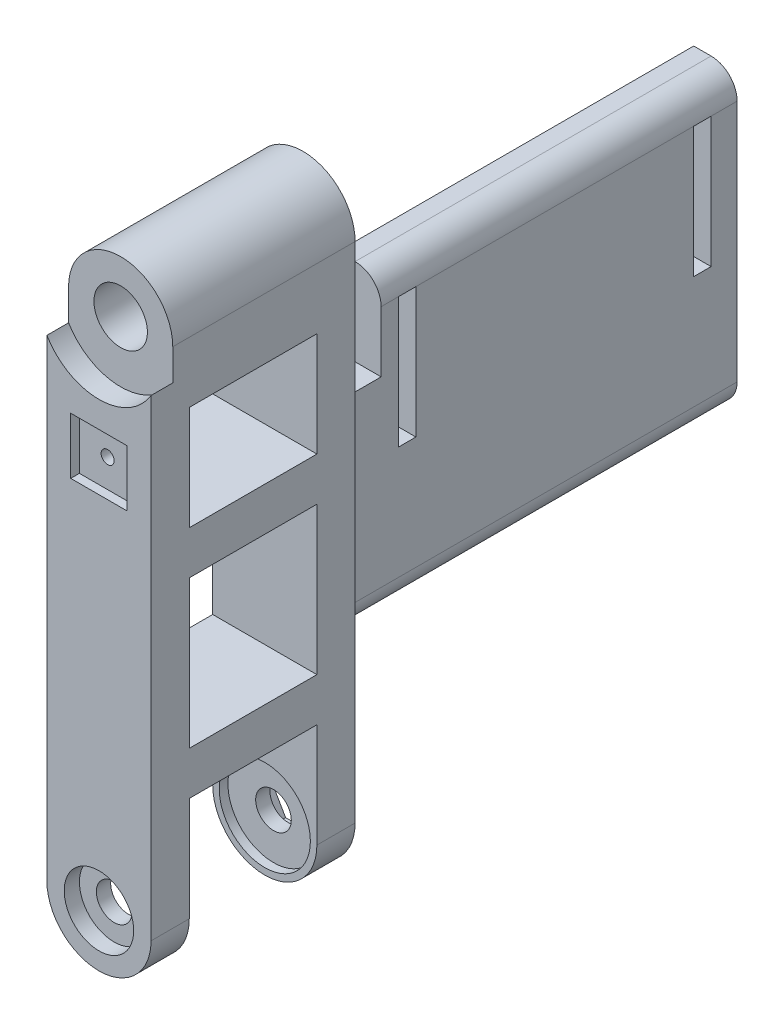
ISO-10303-21;
HEADER;
FILE_DESCRIPTION(('STEP AP214'),'2;1');
FILE_NAME('part.step','',(''),(''),'','','');
FILE_SCHEMA(('AUTOMOTIVE_DESIGN { 1 0 10303 214 1 1 1 1 }'));
ENDSEC;
DATA;
#1=APPLICATION_CONTEXT('core data for automotive mechanical design processes');
#2=APPLICATION_PROTOCOL_DEFINITION('international standard','automotive_design',2000,#1);
#3=PRODUCT_CONTEXT('',#1,'mechanical');
#4=PRODUCT('Part','Part','',(#3));
#5=PRODUCT_RELATED_PRODUCT_CATEGORY('part','',(#4));
#6=PRODUCT_DEFINITION_FORMATION('','',#4);
#7=PRODUCT_DEFINITION_CONTEXT('part definition',#1,'design');
#8=PRODUCT_DEFINITION('design','',#6,#7);
#9=PRODUCT_DEFINITION_SHAPE('','',#8);
#10=(LENGTH_UNIT() NAMED_UNIT(*) SI_UNIT(.MILLI.,.METRE.));
#11=(NAMED_UNIT(*) PLANE_ANGLE_UNIT() SI_UNIT($,.RADIAN.));
#12=(NAMED_UNIT(*) SI_UNIT($,.STERADIAN.) SOLID_ANGLE_UNIT());
#13=UNCERTAINTY_MEASURE_WITH_UNIT(LENGTH_MEASURE(1.E-05),#10,'distance_accuracy_value','');
#14=(GEOMETRIC_REPRESENTATION_CONTEXT(3) GLOBAL_UNCERTAINTY_ASSIGNED_CONTEXT((#13)) GLOBAL_UNIT_ASSIGNED_CONTEXT((#10,
#11,#12)) REPRESENTATION_CONTEXT('',''));
#15=CARTESIAN_POINT('',(0.,0.,0.));
#16=DIRECTION('',(0.,0.,1.));
#17=DIRECTION('',(1.,0.,0.));
#18=AXIS2_PLACEMENT_3D('',#15,#16,#17);
#19=CARTESIAN_POINT('',(0.,36.,-75.5));
#20=DIRECTION('',(0.,-1.,0.));
#21=DIRECTION('',(0.,0.,-1.));
#22=AXIS2_PLACEMENT_3D('',#19,#20,#21);
#23=PLANE('',#22);
#24=DIRECTION('',(1.,0.,0.));
#25=VECTOR('',#24,1.);
#26=CARTESIAN_POINT('',(0.,36.,-34.5));
#27=LINE('',#26,#25);
#28=CARTESIAN_POINT('',(0.,36.,-34.5));
#29=VERTEX_POINT('',#28);
#30=CARTESIAN_POINT('',(4.99999999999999,36.,-34.5));
#31=VERTEX_POINT('',#30);
#32=EDGE_CURVE('E434',#29,#31,#27,.T.);
#33=ORIENTED_EDGE('',*,*,#32,.F.);
#34=DIRECTION('',(0.,0.,1.));
#35=VECTOR('',#34,1.);
#36=CARTESIAN_POINT('',(0.,36.,-75.5));
#37=LINE('',#36,#35);
#38=CARTESIAN_POINT('',(0.,36.,-24.5));
#39=VERTEX_POINT('',#38);
#40=EDGE_CURVE('E530',#29,#39,#37,.T.);
#41=ORIENTED_EDGE('',*,*,#40,.T.);
#42=DIRECTION('',(-1.,0.,0.));
#43=VECTOR('',#42,1.);
#44=CARTESIAN_POINT('',(0.,36.,-24.5));
#45=LINE('',#44,#43);
#46=CARTESIAN_POINT('',(4.99999999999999,36.,-24.5));
#47=VERTEX_POINT('',#46);
#48=EDGE_CURVE('E496',#47,#39,#45,.T.);
#49=ORIENTED_EDGE('',*,*,#48,.F.);
#50=DIRECTION('',(0.,0.,1.));
#51=VECTOR('',#50,1.);
#52=CARTESIAN_POINT('',(4.99999999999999,36.,-75.5));
#53=LINE('',#52,#51);
#54=EDGE_CURVE('E527',#31,#47,#53,.T.);
#55=ORIENTED_EDGE('',*,*,#54,.F.);
#56=EDGE_LOOP('',(#33,#41,#49,#55));
#57=FACE_BOUND('',#56,.T.);
#58=ADVANCED_FACE('F42',(#57),#23,.F.);
#59=CARTESIAN_POINT('',(0.,0.,-25.5));
#60=DIRECTION('',(-1.,0.,0.));
#61=DIRECTION('',(0.,-1.,0.));
#62=AXIS2_PLACEMENT_3D('',#59,#60,#61);
#63=PLANE('',#62);
#64=DIRECTION('',(0.,1.,0.));
#65=VECTOR('',#64,1.);
#66=CARTESIAN_POINT('',(0.,0.,-36.5));
#67=LINE('',#66,#65);
#68=CARTESIAN_POINT('',(0.,28.,-36.5));
#69=VERTEX_POINT('',#68);
#70=CARTESIAN_POINT('',(0.,43.,-36.5));
#71=VERTEX_POINT('',#70);
#72=EDGE_CURVE('E432',#69,#71,#67,.T.);
#73=ORIENTED_EDGE('',*,*,#72,.F.);
#74=DIRECTION('',(0.,0.,1.));
#75=VECTOR('',#74,1.);
#76=CARTESIAN_POINT('',(0.,28.,-25.5));
#77=LINE('',#76,#75);
#78=CARTESIAN_POINT('',(0.,28.,-38.5));
#79=VERTEX_POINT('',#78);
#80=EDGE_CURVE('E425',#79,#69,#77,.T.);
#81=ORIENTED_EDGE('',*,*,#80,.F.);
#82=DIRECTION('',(0.,-1.,0.));
#83=VECTOR('',#82,1.);
#84=CARTESIAN_POINT('',(0.,0.,-38.5));
#85=LINE('',#84,#83);
#86=CARTESIAN_POINT('',(0.,43.,-38.5));
#87=VERTEX_POINT('',#86);
#88=EDGE_CURVE('E427',#87,#79,#85,.T.);
#89=ORIENTED_EDGE('',*,*,#88,.F.);
#90=DIRECTION('',(0.,0.,-1.));
#91=VECTOR('',#90,1.);
#92=CARTESIAN_POINT('',(0.,43.,-25.5));
#93=LINE('',#92,#91);
#94=EDGE_CURVE('E430',#71,#87,#93,.T.);
#95=ORIENTED_EDGE('',*,*,#94,.F.);
#96=EDGE_LOOP('',(#73,#81,#89,#95));
#97=FACE_BOUND('',#96,.T.);
#98=DIRECTION('',(0.,1.,0.));
#99=VECTOR('',#98,1.);
#100=CARTESIAN_POINT('',(0.,0.,-70.5));
#101=LINE('',#100,#99);
#102=CARTESIAN_POINT('',(0.,28.,-70.5));
#103=VERTEX_POINT('',#102);
#104=CARTESIAN_POINT('',(0.,43.,-70.5));
#105=VERTEX_POINT('',#104);
#106=EDGE_CURVE('E423',#103,#105,#101,.T.);
#107=ORIENTED_EDGE('',*,*,#106,.F.);
#108=DIRECTION('',(0.,0.,1.));
#109=VECTOR('',#108,1.);
#110=CARTESIAN_POINT('',(0.,28.,-25.5));
#111=LINE('',#110,#109);
#112=CARTESIAN_POINT('',(0.,28.,-72.5));
#113=VERTEX_POINT('',#112);
#114=EDGE_CURVE('E390',#113,#103,#111,.T.);
#115=ORIENTED_EDGE('',*,*,#114,.F.);
#116=DIRECTION('',(0.,-1.,0.));
#117=VECTOR('',#116,1.);
#118=CARTESIAN_POINT('',(0.,0.,-72.5));
#119=LINE('',#118,#117);
#120=CARTESIAN_POINT('',(0.,43.,-72.5));
#121=VERTEX_POINT('',#120);
#122=EDGE_CURVE('E418',#121,#113,#119,.T.);
#123=ORIENTED_EDGE('',*,*,#122,.F.);
#124=DIRECTION('',(0.,0.,-1.));
#125=VECTOR('',#124,1.);
#126=CARTESIAN_POINT('',(0.,43.,-25.5));
#127=LINE('',#126,#125);
#128=EDGE_CURVE('E421',#105,#121,#127,.T.);
#129=ORIENTED_EDGE('',*,*,#128,.F.);
#130=EDGE_LOOP('',(#107,#115,#123,#129));
#131=FACE_BOUND('',#130,.T.);
#132=DIRECTION('',(0.,1.,0.));
#133=VECTOR('',#132,1.);
#134=CARTESIAN_POINT('',(0.,0.,-5.4));
#135=LINE('',#134,#133);
#136=CARTESIAN_POINT('',(0.,17.,-5.4));
#137=VERTEX_POINT('',#136);
#138=CARTESIAN_POINT('',(0.,34.,-5.4));
#139=VERTEX_POINT('',#138);
#140=EDGE_CURVE('E644',#137,#139,#135,.T.);
#141=ORIENTED_EDGE('',*,*,#140,.F.);
#142=DIRECTION('',(0.,0.,1.));
#143=VECTOR('',#142,1.);
#144=CARTESIAN_POINT('',(0.,17.,-25.5));
#145=LINE('',#144,#143);
#146=CARTESIAN_POINT('',(0.,17.,-20.1));
#147=VERTEX_POINT('',#146);
#148=EDGE_CURVE('E637',#147,#137,#145,.T.);
#149=ORIENTED_EDGE('',*,*,#148,.F.);
#150=DIRECTION('',(0.,-1.,0.));
#151=VECTOR('',#150,1.);
#152=CARTESIAN_POINT('',(0.,0.,-20.1));
#153=LINE('',#152,#151);
#154=CARTESIAN_POINT('',(0.,34.,-20.1));
#155=VERTEX_POINT('',#154);
#156=EDGE_CURVE('E639',#155,#147,#153,.T.);
#157=ORIENTED_EDGE('',*,*,#156,.F.);
#158=DIRECTION('',(0.,0.,-1.));
#159=VECTOR('',#158,1.);
#160=CARTESIAN_POINT('',(0.,34.,-25.5));
#161=LINE('',#160,#159);
#162=EDGE_CURVE('E642',#139,#155,#161,.T.);
#163=ORIENTED_EDGE('',*,*,#162,.F.);
#164=EDGE_LOOP('',(#141,#149,#157,#163));
#165=FACE_BOUND('',#164,.T.);
#166=DIRECTION('',(0.,1.,0.));
#167=VECTOR('',#166,1.);
#168=CARTESIAN_POINT('',(0.,0.,-5.4));
#169=LINE('',#168,#167);
#170=CARTESIAN_POINT('',(0.,39.,-5.4));
#171=VERTEX_POINT('',#170);
#172=CARTESIAN_POINT('',(0.,51.,-5.4));
#173=VERTEX_POINT('',#172);
#174=EDGE_CURVE('E635',#171,#173,#169,.T.);
#175=ORIENTED_EDGE('',*,*,#174,.F.);
#176=DIRECTION('',(0.,0.,1.));
#177=VECTOR('',#176,1.);
#178=CARTESIAN_POINT('',(0.,39.,-25.5));
#179=LINE('',#178,#177);
#180=CARTESIAN_POINT('',(0.,39.,-20.1));
#181=VERTEX_POINT('',#180);
#182=EDGE_CURVE('E628',#181,#171,#179,.T.);
#183=ORIENTED_EDGE('',*,*,#182,.F.);
#184=DIRECTION('',(0.,-1.,0.));
#185=VECTOR('',#184,1.);
#186=CARTESIAN_POINT('',(0.,0.,-20.1));
#187=LINE('',#186,#185);
#188=CARTESIAN_POINT('',(0.,51.,-20.1));
#189=VERTEX_POINT('',#188);
#190=EDGE_CURVE('E630',#189,#181,#187,.T.);
#191=ORIENTED_EDGE('',*,*,#190,.F.);
#192=DIRECTION('',(0.,0.,-1.));
#193=VECTOR('',#192,1.);
#194=CARTESIAN_POINT('',(0.,51.,-25.5));
#195=LINE('',#194,#193);
#196=EDGE_CURVE('E633',#173,#189,#195,.T.);
#197=ORIENTED_EDGE('',*,*,#196,.F.);
#198=EDGE_LOOP('',(#175,#183,#191,#197));
#199=FACE_BOUND('',#198,.T.);
#200=DIRECTION('',(0.,0.,1.));
#201=VECTOR('',#200,1.);
#202=CARTESIAN_POINT('',(0.,58.,-25.5));
#203=LINE('',#202,#201);
#204=CARTESIAN_POINT('',(0.,58.,-24.5));
#205=VERTEX_POINT('',#204);
#206=CARTESIAN_POINT('',(0.,58.,-3.5));
#207=VERTEX_POINT('',#206);
#208=EDGE_CURVE('E653',#205,#207,#203,.T.);
#209=ORIENTED_EDGE('',*,*,#208,.F.);
#210=DIRECTION('',(0.,1.,0.));
#211=VECTOR('',#210,1.);
#212=CARTESIAN_POINT('',(0.,54.394448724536,-24.5));
#213=LINE('',#212,#211);
#214=EDGE_CURVE('E499',#39,#205,#213,.T.);
#215=ORIENTED_EDGE('',*,*,#214,.F.);
#216=ORIENTED_EDGE('',*,*,#40,.F.);
#217=DIRECTION('',(0.,-1.,0.));
#218=VECTOR('',#217,1.);
#219=CARTESIAN_POINT('',(0.,46.,-34.5));
#220=LINE('',#219,#218);
#221=CARTESIAN_POINT('',(0.,46.,-34.5));
#222=VERTEX_POINT('',#221);
#223=EDGE_CURVE('E446',#222,#29,#220,.T.);
#224=ORIENTED_EDGE('',*,*,#223,.F.);
#225=DIRECTION('',(0.,0.,1.));
#226=VECTOR('',#225,1.);
#227=CARTESIAN_POINT('',(0.,46.,-75.5));
#228=LINE('',#227,#226);
#229=CARTESIAN_POINT('',(0.,46.,-75.5));
#230=VERTEX_POINT('',#229);
#231=EDGE_CURVE('E435',#230,#222,#228,.T.);
#232=ORIENTED_EDGE('',*,*,#231,.F.);
#233=DIRECTION('',(0.,1.,0.));
#234=VECTOR('',#233,1.);
#235=CARTESIAN_POINT('',(0.,12.,-75.5));
#236=LINE('',#235,#234);
#237=CARTESIAN_POINT('',(0.,12.,-75.5));
#238=VERTEX_POINT('',#237);
#239=EDGE_CURVE('E524',#238,#230,#236,.T.);
#240=ORIENTED_EDGE('',*,*,#239,.F.);
#241=DIRECTION('',(0.,0.,1.));
#242=VECTOR('',#241,1.);
#243=CARTESIAN_POINT('',(0.,12.,-75.5));
#244=LINE('',#243,#242);
#245=CARTESIAN_POINT('',(0.,12.,-24.5));
#246=VERTEX_POINT('',#245);
#247=EDGE_CURVE('E532',#238,#246,#244,.T.);
#248=ORIENTED_EDGE('',*,*,#247,.T.);
#249=DIRECTION('',(0.,1.,0.));
#250=VECTOR('',#249,1.);
#251=CARTESIAN_POINT('',(0.,12.,-24.5));
#252=LINE('',#251,#250);
#253=CARTESIAN_POINT('',(0.,0.,-24.5));
#254=VERTEX_POINT('',#253);
#255=EDGE_CURVE('E488',#254,#246,#252,.T.);
#256=ORIENTED_EDGE('',*,*,#255,.F.);
#257=DIRECTION('',(0.,0.,1.));
#258=VECTOR('',#257,1.);
#259=CARTESIAN_POINT('',(0.,0.,-25.5));
#260=LINE('',#259,#258);
#261=CARTESIAN_POINT('',(0.,0.,-20.1));
#262=VERTEX_POINT('',#261);
#263=EDGE_CURVE('E649',#254,#262,#260,.T.);
#264=ORIENTED_EDGE('',*,*,#263,.T.);
#265=DIRECTION('',(0.,-1.,0.));
#266=VECTOR('',#265,1.);
#267=CARTESIAN_POINT('',(0.,0.,-20.1));
#268=LINE('',#267,#266);
#269=CARTESIAN_POINT('',(0.,12.,-20.1));
#270=VERTEX_POINT('',#269);
#271=EDGE_CURVE('E577',#270,#262,#268,.T.);
#272=ORIENTED_EDGE('',*,*,#271,.F.);
#273=DIRECTION('',(0.,0.,-1.));
#274=VECTOR('',#273,1.);
#275=CARTESIAN_POINT('',(0.,12.,-25.5));
#276=LINE('',#275,#274);
#277=CARTESIAN_POINT('',(0.,12.,-5.4));
#278=VERTEX_POINT('',#277);
#279=EDGE_CURVE('E646',#278,#270,#276,.T.);
#280=ORIENTED_EDGE('',*,*,#279,.F.);
#281=DIRECTION('',(0.,1.,0.));
#282=VECTOR('',#281,1.);
#283=CARTESIAN_POINT('',(0.,0.,-5.4));
#284=LINE('',#283,#282);
#285=CARTESIAN_POINT('',(0.,0.,-5.4));
#286=VERTEX_POINT('',#285);
#287=EDGE_CURVE('E624',#286,#278,#284,.T.);
#288=ORIENTED_EDGE('',*,*,#287,.F.);
#289=CARTESIAN_POINT('',(0.,0.,-1.));
#290=VERTEX_POINT('',#289);
#291=EDGE_CURVE('E652',#286,#290,#260,.T.);
#292=ORIENTED_EDGE('',*,*,#291,.T.);
#293=DIRECTION('',(0.,-1.,0.));
#294=VECTOR('',#293,1.);
#295=CARTESIAN_POINT('',(0.,54.394448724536,-1.));
#296=LINE('',#295,#294);
#297=CARTESIAN_POINT('',(0.,54.394448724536,-1.));
#298=VERTEX_POINT('',#297);
#299=EDGE_CURVE('E470',#298,#290,#296,.T.);
#300=ORIENTED_EDGE('',*,*,#299,.F.);
#301=DIRECTION('',(0.,0.,1.));
#302=VECTOR('',#301,1.);
#303=CARTESIAN_POINT('',(0.,54.394448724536,-3.5));
#304=LINE('',#303,#302);
#305=CARTESIAN_POINT('',(0.,54.394448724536,-3.5));
#306=VERTEX_POINT('',#305);
#307=EDGE_CURVE('E516',#306,#298,#304,.T.);
#308=ORIENTED_EDGE('',*,*,#307,.F.);
#309=DIRECTION('',(0.,1.,0.));
#310=VECTOR('',#309,1.);
#311=CARTESIAN_POINT('',(0.,0.,-3.5));
#312=LINE('',#311,#310);
#313=EDGE_CURVE('E511',#306,#207,#312,.T.);
#314=ORIENTED_EDGE('',*,*,#313,.T.);
#315=EDGE_LOOP('',(#209,#215,#216,#224,#232,#240,#248,#256,#264,#272,#280,#288,#292,#300,#308,#314));
#316=FACE_BOUND('',#315,.T.);
#317=ADVANCED_FACE('F700',(#97,#131,#165,#199,#316),#63,.T.);
#318=CARTESIAN_POINT('',(12.,0.,-25.5));
#319=DIRECTION('',(1.,0.,0.));
#320=DIRECTION('',(0.,1.,0.));
#321=AXIS2_PLACEMENT_3D('',#318,#319,#320);
#322=PLANE('',#321);
#323=DIRECTION('',(0.,-1.,0.));
#324=VECTOR('',#323,1.);
#325=CARTESIAN_POINT('',(12.,17.,-5.4));
#326=LINE('',#325,#324);
#327=CARTESIAN_POINT('',(12.,34.,-5.4));
#328=VERTEX_POINT('',#327);
#329=CARTESIAN_POINT('',(12.,17.,-5.4));
#330=VERTEX_POINT('',#329);
#331=EDGE_CURVE('E579',#328,#330,#326,.T.);
#332=ORIENTED_EDGE('',*,*,#331,.F.);
#333=DIRECTION('',(0.,0.,1.));
#334=VECTOR('',#333,1.);
#335=CARTESIAN_POINT('',(12.,34.,-5.4));
#336=LINE('',#335,#334);
#337=CARTESIAN_POINT('',(12.,34.,-20.1));
#338=VERTEX_POINT('',#337);
#339=EDGE_CURVE('E588',#338,#328,#336,.T.);
#340=ORIENTED_EDGE('',*,*,#339,.F.);
#341=DIRECTION('',(0.,1.,0.));
#342=VECTOR('',#341,1.);
#343=CARTESIAN_POINT('',(12.,17.,-20.1));
#344=LINE('',#343,#342);
#345=CARTESIAN_POINT('',(12.,17.,-20.1));
#346=VERTEX_POINT('',#345);
#347=EDGE_CURVE('E585',#346,#338,#344,.T.);
#348=ORIENTED_EDGE('',*,*,#347,.F.);
#349=DIRECTION('',(0.,0.,-1.));
#350=VECTOR('',#349,1.);
#351=CARTESIAN_POINT('',(12.,17.,-5.4));
#352=LINE('',#351,#350);
#353=EDGE_CURVE('E581',#330,#346,#352,.T.);
#354=ORIENTED_EDGE('',*,*,#353,.F.);
#355=EDGE_LOOP('',(#332,#340,#348,#354));
#356=FACE_BOUND('',#355,.T.);
#357=DIRECTION('',(0.,-1.,0.));
#358=VECTOR('',#357,1.);
#359=CARTESIAN_POINT('',(12.,39.,-5.4));
#360=LINE('',#359,#358);
#361=CARTESIAN_POINT('',(12.,51.,-5.4));
#362=VERTEX_POINT('',#361);
#363=CARTESIAN_POINT('',(12.,39.,-5.4));
#364=VERTEX_POINT('',#363);
#365=EDGE_CURVE('E599',#362,#364,#360,.T.);
#366=ORIENTED_EDGE('',*,*,#365,.F.);
#367=DIRECTION('',(0.,0.,1.));
#368=VECTOR('',#367,1.);
#369=CARTESIAN_POINT('',(12.,51.,-5.4));
#370=LINE('',#369,#368);
#371=CARTESIAN_POINT('',(12.,51.,-20.1));
#372=VERTEX_POINT('',#371);
#373=EDGE_CURVE('E608',#372,#362,#370,.T.);
#374=ORIENTED_EDGE('',*,*,#373,.F.);
#375=DIRECTION('',(0.,1.,0.));
#376=VECTOR('',#375,1.);
#377=CARTESIAN_POINT('',(12.,39.,-20.1));
#378=LINE('',#377,#376);
#379=CARTESIAN_POINT('',(12.,39.,-20.1));
#380=VERTEX_POINT('',#379);
#381=EDGE_CURVE('E605',#380,#372,#378,.T.);
#382=ORIENTED_EDGE('',*,*,#381,.F.);
#383=DIRECTION('',(0.,0.,-1.));
#384=VECTOR('',#383,1.);
#385=CARTESIAN_POINT('',(12.,39.,-5.4));
#386=LINE('',#385,#384);
#387=EDGE_CURVE('E601',#364,#380,#386,.T.);
#388=ORIENTED_EDGE('',*,*,#387,.F.);
#389=EDGE_LOOP('',(#366,#374,#382,#388));
#390=FACE_BOUND('',#389,.T.);
#391=DIRECTION('',(0.,-1.,0.));
#392=VECTOR('',#391,1.);
#393=CARTESIAN_POINT('',(12.,54.394448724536,-24.5));
#394=LINE('',#393,#392);
#395=CARTESIAN_POINT('',(12.,58.,-24.5));
#396=VERTEX_POINT('',#395);
#397=CARTESIAN_POINT('',(12.,0.,-24.5));
#398=VERTEX_POINT('',#397);
#399=EDGE_CURVE('E484',#396,#398,#394,.T.);
#400=ORIENTED_EDGE('',*,*,#399,.F.);
#401=DIRECTION('',(0.,0.,1.));
#402=VECTOR('',#401,1.);
#403=CARTESIAN_POINT('',(12.,58.,-25.5));
#404=LINE('',#403,#402);
#405=CARTESIAN_POINT('',(12.,58.,-3.5));
#406=VERTEX_POINT('',#405);
#407=EDGE_CURVE('E655',#396,#406,#404,.T.);
#408=ORIENTED_EDGE('',*,*,#407,.T.);
#409=DIRECTION('',(0.,-1.,0.));
#410=VECTOR('',#409,1.);
#411=CARTESIAN_POINT('',(12.,0.,-3.5));
#412=LINE('',#411,#410);
#413=CARTESIAN_POINT('',(12.,54.394448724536,-3.5));
#414=VERTEX_POINT('',#413);
#415=EDGE_CURVE('E505',#406,#414,#412,.T.);
#416=ORIENTED_EDGE('',*,*,#415,.T.);
#417=DIRECTION('',(0.,0.,1.));
#418=VECTOR('',#417,1.);
#419=CARTESIAN_POINT('',(12.,54.394448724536,-3.5));
#420=LINE('',#419,#418);
#421=CARTESIAN_POINT('',(12.,54.394448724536,-1.));
#422=VERTEX_POINT('',#421);
#423=EDGE_CURVE('E514',#422,#414,#420,.F.);
#424=ORIENTED_EDGE('',*,*,#423,.F.);
#425=DIRECTION('',(0.,1.,0.));
#426=VECTOR('',#425,1.);
#427=CARTESIAN_POINT('',(12.,54.394448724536,-1.));
#428=LINE('',#427,#426);
#429=CARTESIAN_POINT('',(12.,0.,-1.));
#430=VERTEX_POINT('',#429);
#431=EDGE_CURVE('E474',#430,#422,#428,.T.);
#432=ORIENTED_EDGE('',*,*,#431,.F.);
#433=DIRECTION('',(0.,0.,1.));
#434=VECTOR('',#433,1.);
#435=CARTESIAN_POINT('',(12.,0.,-25.5));
#436=LINE('',#435,#434);
#437=CARTESIAN_POINT('',(12.,0.,-5.4));
#438=VERTEX_POINT('',#437);
#439=EDGE_CURVE('E648',#438,#430,#436,.T.);
#440=ORIENTED_EDGE('',*,*,#439,.F.);
#441=DIRECTION('',(0.,-1.,0.));
#442=VECTOR('',#441,1.);
#443=CARTESIAN_POINT('',(12.,-6.,-5.4));
#444=LINE('',#443,#442);
#445=CARTESIAN_POINT('',(12.,12.,-5.4));
#446=VERTEX_POINT('',#445);
#447=EDGE_CURVE('E565',#446,#438,#444,.T.);
#448=ORIENTED_EDGE('',*,*,#447,.F.);
#449=DIRECTION('',(0.,0.,1.));
#450=VECTOR('',#449,1.);
#451=CARTESIAN_POINT('',(12.,12.,-5.4));
#452=LINE('',#451,#450);
#453=CARTESIAN_POINT('',(12.,12.,-20.1));
#454=VERTEX_POINT('',#453);
#455=EDGE_CURVE('E571',#454,#446,#452,.T.);
#456=ORIENTED_EDGE('',*,*,#455,.F.);
#457=DIRECTION('',(0.,1.,0.));
#458=VECTOR('',#457,1.);
#459=CARTESIAN_POINT('',(12.,-6.,-20.1));
#460=LINE('',#459,#458);
#461=CARTESIAN_POINT('',(12.,0.,-20.1));
#462=VERTEX_POINT('',#461);
#463=EDGE_CURVE('E567',#462,#454,#460,.T.);
#464=ORIENTED_EDGE('',*,*,#463,.F.);
#465=EDGE_CURVE('E657',#398,#462,#436,.T.);
#466=ORIENTED_EDGE('',*,*,#465,.F.);
#467=EDGE_LOOP('',(#400,#408,#416,#424,#432,#440,#448,#456,#464,#466));
#468=FACE_BOUND('',#467,.T.);
#469=ADVANCED_FACE('F793',(#356,#390,#468),#322,.T.);
#470=CARTESIAN_POINT('',(5.99999999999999,58.,-25.5));
#471=DIRECTION('',(0.,0.,1.));
#472=DIRECTION('',(1.,0.,0.));
#473=AXIS2_PLACEMENT_3D('',#470,#471,#472);
#474=CYLINDRICAL_SURFACE('',#473,6.);
#475=ORIENTED_EDGE('',*,*,#407,.F.);
#476=CARTESIAN_POINT('',(5.99999999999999,58.,-24.5));
#477=DIRECTION('',(0.,0.,-1.));
#478=DIRECTION('',(-1.,0.,0.));
#479=AXIS2_PLACEMENT_3D('',#476,#477,#478);
#480=CIRCLE('',#479,6.);
#481=EDGE_CURVE('E451',#396,#205,#480,.F.);
#482=ORIENTED_EDGE('',*,*,#481,.T.);
#483=ORIENTED_EDGE('',*,*,#208,.T.);
#484=CARTESIAN_POINT('',(5.99999999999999,58.,-3.5));
#485=DIRECTION('',(0.,0.,1.));
#486=DIRECTION('',(1.,0.,0.));
#487=AXIS2_PLACEMENT_3D('',#484,#485,#486);
#488=CIRCLE('',#487,6.);
#489=EDGE_CURVE('E508',#207,#406,#488,.F.);
#490=ORIENTED_EDGE('',*,*,#489,.T.);
#491=EDGE_LOOP('',(#475,#482,#483,#490));
#492=FACE_BOUND('',#491,.T.);
#493=ADVANCED_FACE('F811',(#492),#474,.T.);
#494=CARTESIAN_POINT('',(5.99999999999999,58.,-25.5));
#495=DIRECTION('',(0.,0.,1.));
#496=DIRECTION('',(1.,0.,0.));
#497=AXIS2_PLACEMENT_3D('',#494,#495,#496);
#498=CYLINDRICAL_SURFACE('',#497,3.08);
#499=CARTESIAN_POINT('',(5.99999999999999,58.,-3.5));
#500=DIRECTION('',(0.,0.,1.));
#501=DIRECTION('',(1.,0.,0.));
#502=AXIS2_PLACEMENT_3D('',#499,#500,#501);
#503=CIRCLE('',#502,3.08);
#504=CARTESIAN_POINT('',(9.07999999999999,58.,-3.5));
#505=VERTEX_POINT('',#504);
#506=EDGE_CURVE('E504',#505,#505,#503,.F.);
#507=ORIENTED_EDGE('',*,*,#506,.F.);
#508=EDGE_LOOP('',(#507));
#509=FACE_BOUND('',#508,.T.);
#510=CARTESIAN_POINT('',(5.99999999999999,58.,-24.5));
#511=DIRECTION('',(0.,0.,-1.));
#512=DIRECTION('',(-1.,0.,0.));
#513=AXIS2_PLACEMENT_3D('',#510,#511,#512);
#514=CIRCLE('',#513,3.08);
#515=CARTESIAN_POINT('',(2.91999999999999,58.,-24.5));
#516=VERTEX_POINT('',#515);
#517=EDGE_CURVE('E448',#516,#516,#514,.F.);
#518=ORIENTED_EDGE('',*,*,#517,.F.);
#519=EDGE_LOOP('',(#518));
#520=FACE_BOUND('',#519,.T.);
#521=ADVANCED_FACE('F814',(#509,#520),#498,.F.);
#522=CARTESIAN_POINT('',(6.,0.,-25.5));
#523=DIRECTION('',(0.,0.,1.));
#524=DIRECTION('',(1.,0.,0.));
#525=AXIS2_PLACEMENT_3D('',#522,#523,#524);
#526=CYLINDRICAL_SURFACE('',#525,2.05);
#527=CARTESIAN_POINT('',(6.,0.,-2.75));
#528=DIRECTION('',(0.,0.,1.));
#529=DIRECTION('',(1.,0.,0.));
#530=AXIS2_PLACEMENT_3D('',#527,#528,#529);
#531=CIRCLE('',#530,2.05);
#532=CARTESIAN_POINT('',(8.05,0.,-2.75));
#533=VERTEX_POINT('',#532);
#534=EDGE_CURVE('E602',#533,#533,#531,.F.);
#535=ORIENTED_EDGE('',*,*,#534,.F.);
#536=EDGE_LOOP('',(#535));
#537=FACE_BOUND('',#536,.T.);
#538=CARTESIAN_POINT('',(6.,0.,-4.4));
#539=DIRECTION('',(0.,0.,-1.));
#540=DIRECTION('',(-1.,0.,0.));
#541=AXIS2_PLACEMENT_3D('',#538,#539,#540);
#542=CIRCLE('',#541,2.05);
#543=CARTESIAN_POINT('',(3.95,0.,-4.4));
#544=VERTEX_POINT('',#543);
#545=EDGE_CURVE('E458',#544,#544,#542,.F.);
#546=ORIENTED_EDGE('',*,*,#545,.F.);
#547=EDGE_LOOP('',(#546));
#548=FACE_BOUND('',#547,.T.);
#549=ADVANCED_FACE('F820',(#537,#548),#526,.F.);
#550=CARTESIAN_POINT('',(6.,0.,-22.75));
#551=DIRECTION('',(0.,0.,-1.));
#552=DIRECTION('',(-1.,0.,0.));
#553=AXIS2_PLACEMENT_3D('',#550,#551,#552);
#554=CIRCLE('',#553,2.05);
#555=CARTESIAN_POINT('',(3.95,0.,-22.75));
#556=VERTEX_POINT('',#555);
#557=EDGE_CURVE('E556',#556,#556,#554,.F.);
#558=ORIENTED_EDGE('',*,*,#557,.F.);
#559=EDGE_LOOP('',(#558));
#560=FACE_BOUND('',#559,.T.);
#561=CARTESIAN_POINT('',(6.,0.,-21.1));
#562=DIRECTION('',(0.,0.,1.));
#563=DIRECTION('',(1.,0.,0.));
#564=AXIS2_PLACEMENT_3D('',#561,#562,#563);
#565=CIRCLE('',#564,2.05);
#566=CARTESIAN_POINT('',(8.05,0.,-21.1));
#567=VERTEX_POINT('',#566);
#568=EDGE_CURVE('E464',#567,#567,#565,.F.);
#569=ORIENTED_EDGE('',*,*,#568,.F.);
#570=EDGE_LOOP('',(#569));
#571=FACE_BOUND('',#570,.T.);
#572=ADVANCED_FACE('F911',(#560,#571),#526,.F.);
#573=CARTESIAN_POINT('',(6.,0.,-25.5));
#574=DIRECTION('',(0.,0.,1.));
#575=DIRECTION('',(1.,0.,0.));
#576=AXIS2_PLACEMENT_3D('',#573,#574,#575);
#577=CYLINDRICAL_SURFACE('',#576,6.);
#578=ORIENTED_EDGE('',*,*,#439,.T.);
#579=CARTESIAN_POINT('',(6.,0.,-1.));
#580=DIRECTION('',(0.,0.,1.));
#581=DIRECTION('',(1.,0.,0.));
#582=AXIS2_PLACEMENT_3D('',#579,#580,#581);
#583=CIRCLE('',#582,6.);
#584=EDGE_CURVE('E472',#290,#430,#583,.T.);
#585=ORIENTED_EDGE('',*,*,#584,.F.);
#586=ORIENTED_EDGE('',*,*,#291,.F.);
#587=CARTESIAN_POINT('',(6.,0.,-5.4));
#588=DIRECTION('',(0.,0.,1.));
#589=DIRECTION('',(1.,0.,0.));
#590=AXIS2_PLACEMENT_3D('',#587,#588,#589);
#591=CIRCLE('',#590,6.);
#592=EDGE_CURVE('E626',#438,#286,#591,.F.);
#593=ORIENTED_EDGE('',*,*,#592,.F.);
#594=EDGE_LOOP('',(#578,#585,#586,#593));
#595=FACE_BOUND('',#594,.T.);
#596=ADVANCED_FACE('F789',(#595),#577,.T.);
#597=CARTESIAN_POINT('',(2.74999999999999,48.,-2.));
#598=DIRECTION('',(-1.,0.,0.));
#599=DIRECTION('',(0.,-1.,0.));
#600=AXIS2_PLACEMENT_3D('',#597,#598,#599);
#601=PLANE('',#600);
#602=DIRECTION('',(0.,1.,0.));
#603=VECTOR('',#602,1.);
#604=CARTESIAN_POINT('',(2.74999999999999,48.,-1.));
#605=LINE('',#604,#603);
#606=CARTESIAN_POINT('',(2.74999999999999,41.5,-1.));
#607=VERTEX_POINT('',#606);
#608=CARTESIAN_POINT('',(2.74999999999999,48.,-1.));
#609=VERTEX_POINT('',#608);
#610=EDGE_CURVE('E482',#607,#609,#605,.T.);
#611=ORIENTED_EDGE('',*,*,#610,.F.);
#612=DIRECTION('',(0.,0.,1.));
#613=VECTOR('',#612,1.);
#614=CARTESIAN_POINT('',(2.74999999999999,41.5,-2.));
#615=LINE('',#614,#613);
#616=CARTESIAN_POINT('',(2.74999999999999,41.5,-2.));
#617=VERTEX_POINT('',#616);
#618=EDGE_CURVE('E552',#617,#607,#615,.T.);
#619=ORIENTED_EDGE('',*,*,#618,.F.);
#620=DIRECTION('',(0.,-1.,0.));
#621=VECTOR('',#620,1.);
#622=CARTESIAN_POINT('',(2.74999999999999,48.,-2.));
#623=LINE('',#622,#621);
#624=CARTESIAN_POINT('',(2.74999999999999,48.,-2.));
#625=VERTEX_POINT('',#624);
#626=EDGE_CURVE('E540',#625,#617,#623,.T.);
#627=ORIENTED_EDGE('',*,*,#626,.F.);
#628=DIRECTION('',(0.,0.,1.));
#629=VECTOR('',#628,1.);
#630=CARTESIAN_POINT('',(2.74999999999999,48.,-2.));
#631=LINE('',#630,#629);
#632=EDGE_CURVE('E553',#625,#609,#631,.T.);
#633=ORIENTED_EDGE('',*,*,#632,.T.);
#634=EDGE_LOOP('',(#611,#619,#627,#633));
#635=FACE_BOUND('',#634,.T.);
#636=ADVANCED_FACE('F852',(#635),#601,.F.);
#637=CARTESIAN_POINT('',(2.74999999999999,48.,-2.));
#638=DIRECTION('',(0.,1.,0.));
#639=DIRECTION('',(0.,0.,1.));
#640=AXIS2_PLACEMENT_3D('',#637,#638,#639);
#641=PLANE('',#640);
#642=DIRECTION('',(1.,0.,0.));
#643=VECTOR('',#642,1.);
#644=CARTESIAN_POINT('',(2.74999999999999,48.,-1.));
#645=LINE('',#644,#643);
#646=CARTESIAN_POINT('',(9.24999999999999,48.,-1.));
#647=VERTEX_POINT('',#646);
#648=EDGE_CURVE('E480',#609,#647,#645,.T.);
#649=ORIENTED_EDGE('',*,*,#648,.F.);
#650=ORIENTED_EDGE('',*,*,#632,.F.);
#651=DIRECTION('',(-1.,0.,0.));
#652=VECTOR('',#651,1.);
#653=CARTESIAN_POINT('',(2.74999999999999,48.,-2.));
#654=LINE('',#653,#652);
#655=CARTESIAN_POINT('',(9.24999999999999,48.,-2.));
#656=VERTEX_POINT('',#655);
#657=EDGE_CURVE('E549',#656,#625,#654,.T.);
#658=ORIENTED_EDGE('',*,*,#657,.F.);
#659=DIRECTION('',(0.,0.,1.));
#660=VECTOR('',#659,1.);
#661=CARTESIAN_POINT('',(9.24999999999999,48.,-2.));
#662=LINE('',#661,#660);
#663=EDGE_CURVE('E557',#656,#647,#662,.T.);
#664=ORIENTED_EDGE('',*,*,#663,.T.);
#665=EDGE_LOOP('',(#649,#650,#658,#664));
#666=FACE_BOUND('',#665,.T.);
#667=ADVANCED_FACE('F848',(#666),#641,.F.);
#668=CARTESIAN_POINT('',(9.24999999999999,48.,-2.));
#669=DIRECTION('',(1.,0.,0.));
#670=DIRECTION('',(0.,0.,-1.));
#671=AXIS2_PLACEMENT_3D('',#668,#669,#670);
#672=PLANE('',#671);
#673=DIRECTION('',(0.,-1.,0.));
#674=VECTOR('',#673,1.);
#675=CARTESIAN_POINT('',(9.24999999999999,48.,-1.));
#676=LINE('',#675,#674);
#677=CARTESIAN_POINT('',(9.24999999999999,41.5,-1.));
#678=VERTEX_POINT('',#677);
#679=EDGE_CURVE('E478',#647,#678,#676,.T.);
#680=ORIENTED_EDGE('',*,*,#679,.F.);
#681=ORIENTED_EDGE('',*,*,#663,.F.);
#682=DIRECTION('',(0.,1.,0.));
#683=VECTOR('',#682,1.);
#684=CARTESIAN_POINT('',(9.24999999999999,48.,-2.));
#685=LINE('',#684,#683);
#686=CARTESIAN_POINT('',(9.24999999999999,41.5,-2.));
#687=VERTEX_POINT('',#686);
#688=EDGE_CURVE('E546',#687,#656,#685,.T.);
#689=ORIENTED_EDGE('',*,*,#688,.F.);
#690=DIRECTION('',(0.,0.,1.));
#691=VECTOR('',#690,1.);
#692=CARTESIAN_POINT('',(9.24999999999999,41.5,-2.));
#693=LINE('',#692,#691);
#694=EDGE_CURVE('E560',#687,#678,#693,.T.);
#695=ORIENTED_EDGE('',*,*,#694,.T.);
#696=EDGE_LOOP('',(#680,#681,#689,#695));
#697=FACE_BOUND('',#696,.T.);
#698=ADVANCED_FACE('F851',(#697),#672,.F.);
#699=CARTESIAN_POINT('',(2.74999999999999,41.5,-2.));
#700=DIRECTION('',(0.,-1.,0.));
#701=DIRECTION('',(0.,0.,-1.));
#702=AXIS2_PLACEMENT_3D('',#699,#700,#701);
#703=PLANE('',#702);
#704=DIRECTION('',(-1.,0.,0.));
#705=VECTOR('',#704,1.);
#706=CARTESIAN_POINT('',(2.74999999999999,41.5,-1.));
#707=LINE('',#706,#705);
#708=EDGE_CURVE('E476',#678,#607,#707,.T.);
#709=ORIENTED_EDGE('',*,*,#708,.F.);
#710=ORIENTED_EDGE('',*,*,#694,.F.);
#711=DIRECTION('',(1.,0.,0.));
#712=VECTOR('',#711,1.);
#713=CARTESIAN_POINT('',(2.74999999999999,41.5,-2.));
#714=LINE('',#713,#712);
#715=EDGE_CURVE('E543',#617,#687,#714,.T.);
#716=ORIENTED_EDGE('',*,*,#715,.F.);
#717=ORIENTED_EDGE('',*,*,#618,.T.);
#718=EDGE_LOOP('',(#709,#710,#716,#717));
#719=FACE_BOUND('',#718,.T.);
#720=ADVANCED_FACE('F856',(#719),#703,.F.);
#721=CARTESIAN_POINT('',(5.99999999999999,58.,-3.5));
#722=DIRECTION('',(0.,0.,1.));
#723=DIRECTION('',(1.,0.,0.));
#724=AXIS2_PLACEMENT_3D('',#721,#722,#723);
#725=CYLINDRICAL_SURFACE('',#724,7.);
#726=CARTESIAN_POINT('',(5.99999999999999,58.,-1.));
#727=DIRECTION('',(0.,0.,-1.));
#728=DIRECTION('',(1.,0.,0.));
#729=AXIS2_PLACEMENT_3D('',#726,#727,#728);
#730=CIRCLE('',#729,7.);
#731=EDGE_CURVE('E468',#422,#298,#730,.T.);
#732=ORIENTED_EDGE('',*,*,#731,.F.);
#733=ORIENTED_EDGE('',*,*,#423,.T.);
#734=CARTESIAN_POINT('',(5.99999999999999,58.,-3.5));
#735=DIRECTION('',(0.,0.,1.));
#736=DIRECTION('',(1.,0.,0.));
#737=AXIS2_PLACEMENT_3D('',#734,#735,#736);
#738=CIRCLE('',#737,7.);
#739=EDGE_CURVE('E501',#306,#414,#738,.T.);
#740=ORIENTED_EDGE('',*,*,#739,.F.);
#741=ORIENTED_EDGE('',*,*,#307,.T.);
#742=EDGE_LOOP('',(#732,#733,#740,#741));
#743=FACE_BOUND('',#742,.T.);
#744=ADVANCED_FACE('F801',(#743),#725,.F.);
#745=ORIENTED_EDGE('',*,*,#263,.F.);
#746=CARTESIAN_POINT('',(6.,0.,-24.5));
#747=DIRECTION('',(0.,0.,-1.));
#748=DIRECTION('',(-1.,0.,0.));
#749=AXIS2_PLACEMENT_3D('',#746,#747,#748);
#750=CIRCLE('',#749,6.);
#751=EDGE_CURVE('E486',#398,#254,#750,.T.);
#752=ORIENTED_EDGE('',*,*,#751,.F.);
#753=ORIENTED_EDGE('',*,*,#465,.T.);
#754=CARTESIAN_POINT('',(6.,0.,-20.1));
#755=DIRECTION('',(0.,0.,-1.));
#756=DIRECTION('',(-1.,0.,0.));
#757=AXIS2_PLACEMENT_3D('',#754,#755,#756);
#758=CIRCLE('',#757,6.);
#759=EDGE_CURVE('E621',#262,#462,#758,.F.);
#760=ORIENTED_EDGE('',*,*,#759,.F.);
#761=EDGE_LOOP('',(#745,#752,#753,#760));
#762=FACE_BOUND('',#761,.T.);
#763=ADVANCED_FACE('F768',(#762),#577,.T.);
#764=CARTESIAN_POINT('',(-8.,-6.,-5.4));
#765=DIRECTION('',(0.,0.,1.));
#766=DIRECTION('',(1.,0.,0.));
#767=AXIS2_PLACEMENT_3D('',#764,#765,#766);
#768=PLANE('',#767);
#769=CARTESIAN_POINT('',(5.87035313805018,0.,-5.4));
#770=DIRECTION('',(0.,0.,-1.));
#771=DIRECTION('',(-1.,0.,0.));
#772=AXIS2_PLACEMENT_3D('',#769,#770,#771);
#773=CIRCLE('',#772,5.25);
#774=CARTESIAN_POINT('',(0.620353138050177,0.,-5.4));
#775=VERTEX_POINT('',#774);
#776=EDGE_CURVE('E454',#775,#775,#773,.T.);
#777=ORIENTED_EDGE('',*,*,#776,.F.);
#778=EDGE_LOOP('',(#777));
#779=FACE_BOUND('',#778,.T.);
#780=ORIENTED_EDGE('',*,*,#592,.T.);
#781=ORIENTED_EDGE('',*,*,#287,.T.);
#782=DIRECTION('',(1.,0.,0.));
#783=VECTOR('',#782,1.);
#784=CARTESIAN_POINT('',(-8.,12.,-5.4));
#785=LINE('',#784,#783);
#786=EDGE_CURVE('E575',#278,#446,#785,.T.);
#787=ORIENTED_EDGE('',*,*,#786,.T.);
#788=ORIENTED_EDGE('',*,*,#447,.T.);
#789=EDGE_LOOP('',(#780,#781,#787,#788));
#790=FACE_BOUND('',#789,.T.);
#791=ADVANCED_FACE('F784',(#779,#790),#768,.F.);
#792=CARTESIAN_POINT('',(-8.,-6.,-20.1));
#793=DIRECTION('',(0.,0.,-1.));
#794=DIRECTION('',(-1.,0.,0.));
#795=AXIS2_PLACEMENT_3D('',#792,#793,#794);
#796=PLANE('',#795);
#797=CARTESIAN_POINT('',(6.,0.,-20.1));
#798=DIRECTION('',(0.,0.,1.));
#799=DIRECTION('',(1.,0.,0.));
#800=AXIS2_PLACEMENT_3D('',#797,#798,#799);
#801=CIRCLE('',#800,5.25);
#802=CARTESIAN_POINT('',(11.25,0.,-20.1));
#803=VERTEX_POINT('',#802);
#804=EDGE_CURVE('E465',#803,#803,#801,.T.);
#805=ORIENTED_EDGE('',*,*,#804,.F.);
#806=EDGE_LOOP('',(#805));
#807=FACE_BOUND('',#806,.T.);
#808=ORIENTED_EDGE('',*,*,#759,.T.);
#809=ORIENTED_EDGE('',*,*,#463,.T.);
#810=DIRECTION('',(1.,0.,0.));
#811=VECTOR('',#810,1.);
#812=CARTESIAN_POINT('',(-8.,12.,-20.1));
#813=LINE('',#812,#811);
#814=EDGE_CURVE('E574',#270,#454,#813,.T.);
#815=ORIENTED_EDGE('',*,*,#814,.F.);
#816=ORIENTED_EDGE('',*,*,#271,.T.);
#817=EDGE_LOOP('',(#808,#809,#815,#816));
#818=FACE_BOUND('',#817,.T.);
#819=ADVANCED_FACE('F773',(#807,#818),#796,.F.);
#820=CARTESIAN_POINT('',(-8.,12.,-5.4));
#821=DIRECTION('',(0.,1.,0.));
#822=DIRECTION('',(-1.,0.,0.));
#823=AXIS2_PLACEMENT_3D('',#820,#821,#822);
#824=PLANE('',#823);
#825=ORIENTED_EDGE('',*,*,#279,.T.);
#826=ORIENTED_EDGE('',*,*,#814,.T.);
#827=ORIENTED_EDGE('',*,*,#455,.T.);
#828=ORIENTED_EDGE('',*,*,#786,.F.);
#829=EDGE_LOOP('',(#825,#826,#827,#828));
#830=FACE_BOUND('',#829,.T.);
#831=ADVANCED_FACE('F780',(#830),#824,.F.);
#832=CARTESIAN_POINT('',(-8.00000000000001,39.,-5.4));
#833=DIRECTION('',(0.,0.,1.));
#834=DIRECTION('',(1.,0.,0.));
#835=AXIS2_PLACEMENT_3D('',#832,#833,#834);
#836=PLANE('',#835);
#837=CARTESIAN_POINT('',(5.99999999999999,44.75,-5.4));
#838=DIRECTION('',(0.,0.,1.));
#839=DIRECTION('',(1.,0.,0.));
#840=AXIS2_PLACEMENT_3D('',#837,#838,#839);
#841=CIRCLE('',#840,0.750000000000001);
#842=CARTESIAN_POINT('',(6.74999999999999,44.75,-5.4));
#843=VERTEX_POINT('',#842);
#844=EDGE_CURVE('E537',#843,#843,#841,.F.);
#845=ORIENTED_EDGE('',*,*,#844,.F.);
#846=EDGE_LOOP('',(#845));
#847=FACE_BOUND('',#846,.T.);
#848=ORIENTED_EDGE('',*,*,#174,.T.);
#849=DIRECTION('',(1.,0.,0.));
#850=VECTOR('',#849,1.);
#851=CARTESIAN_POINT('',(-8.00000000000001,51.,-5.4));
#852=LINE('',#851,#850);
#853=EDGE_CURVE('E582',#173,#362,#852,.T.);
#854=ORIENTED_EDGE('',*,*,#853,.T.);
#855=ORIENTED_EDGE('',*,*,#365,.T.);
#856=DIRECTION('',(1.,0.,0.));
#857=VECTOR('',#856,1.);
#858=CARTESIAN_POINT('',(-8.00000000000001,39.,-5.4));
#859=LINE('',#858,#857);
#860=EDGE_CURVE('E611',#171,#364,#859,.T.);
#861=ORIENTED_EDGE('',*,*,#860,.F.);
#862=EDGE_LOOP('',(#848,#854,#855,#861));
#863=FACE_BOUND('',#862,.T.);
#864=ADVANCED_FACE('F874',(#847,#863),#836,.F.);
#865=CARTESIAN_POINT('',(-8.00000000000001,51.,-5.4));
#866=DIRECTION('',(0.,1.,0.));
#867=DIRECTION('',(-1.,0.,0.));
#868=AXIS2_PLACEMENT_3D('',#865,#866,#867);
#869=PLANE('',#868);
#870=ORIENTED_EDGE('',*,*,#196,.T.);
#871=DIRECTION('',(1.,0.,0.));
#872=VECTOR('',#871,1.);
#873=CARTESIAN_POINT('',(-8.00000000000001,51.,-20.1));
#874=LINE('',#873,#872);
#875=EDGE_CURVE('E613',#189,#372,#874,.T.);
#876=ORIENTED_EDGE('',*,*,#875,.T.);
#877=ORIENTED_EDGE('',*,*,#373,.T.);
#878=ORIENTED_EDGE('',*,*,#853,.F.);
#879=EDGE_LOOP('',(#870,#876,#877,#878));
#880=FACE_BOUND('',#879,.T.);
#881=ADVANCED_FACE('F897',(#880),#869,.F.);
#882=CARTESIAN_POINT('',(-8.00000000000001,39.,-20.1));
#883=DIRECTION('',(0.,0.,-1.));
#884=DIRECTION('',(-1.,0.,0.));
#885=AXIS2_PLACEMENT_3D('',#882,#883,#884);
#886=PLANE('',#885);
#887=ORIENTED_EDGE('',*,*,#190,.T.);
#888=DIRECTION('',(1.,0.,0.));
#889=VECTOR('',#888,1.);
#890=CARTESIAN_POINT('',(-8.00000000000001,39.,-20.1));
#891=LINE('',#890,#889);
#892=EDGE_CURVE('E615',#181,#380,#891,.T.);
#893=ORIENTED_EDGE('',*,*,#892,.T.);
#894=ORIENTED_EDGE('',*,*,#381,.T.);
#895=ORIENTED_EDGE('',*,*,#875,.F.);
#896=EDGE_LOOP('',(#887,#893,#894,#895));
#897=FACE_BOUND('',#896,.T.);
#898=ADVANCED_FACE('F900',(#897),#886,.F.);
#899=CARTESIAN_POINT('',(-8.00000000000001,39.,-5.4));
#900=DIRECTION('',(0.,-1.,0.));
#901=DIRECTION('',(1.,0.,0.));
#902=AXIS2_PLACEMENT_3D('',#899,#900,#901);
#903=PLANE('',#902);
#904=ORIENTED_EDGE('',*,*,#182,.T.);
#905=ORIENTED_EDGE('',*,*,#860,.T.);
#906=ORIENTED_EDGE('',*,*,#387,.T.);
#907=ORIENTED_EDGE('',*,*,#892,.F.);
#908=EDGE_LOOP('',(#904,#905,#906,#907));
#909=FACE_BOUND('',#908,.T.);
#910=ADVANCED_FACE('F895',(#909),#903,.F.);
#911=CARTESIAN_POINT('',(-8.,17.,-5.4));
#912=DIRECTION('',(0.,0.,1.));
#913=DIRECTION('',(1.,0.,0.));
#914=AXIS2_PLACEMENT_3D('',#911,#912,#913);
#915=PLANE('',#914);
#916=ORIENTED_EDGE('',*,*,#140,.T.);
#917=DIRECTION('',(1.,0.,0.));
#918=VECTOR('',#917,1.);
#919=CARTESIAN_POINT('',(-8.00000000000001,34.,-5.4));
#920=LINE('',#919,#918);
#921=EDGE_CURVE('E568',#139,#328,#920,.T.);
#922=ORIENTED_EDGE('',*,*,#921,.T.);
#923=ORIENTED_EDGE('',*,*,#331,.T.);
#924=DIRECTION('',(1.,0.,0.));
#925=VECTOR('',#924,1.);
#926=CARTESIAN_POINT('',(-8.,17.,-5.4));
#927=LINE('',#926,#925);
#928=EDGE_CURVE('E591',#137,#330,#927,.T.);
#929=ORIENTED_EDGE('',*,*,#928,.F.);
#930=EDGE_LOOP('',(#916,#922,#923,#929));
#931=FACE_BOUND('',#930,.T.);
#932=ADVANCED_FACE('F885',(#931),#915,.F.);
#933=CARTESIAN_POINT('',(-8.00000000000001,34.,-5.4));
#934=DIRECTION('',(0.,1.,0.));
#935=DIRECTION('',(-1.,0.,0.));
#936=AXIS2_PLACEMENT_3D('',#933,#934,#935);
#937=PLANE('',#936);
#938=ORIENTED_EDGE('',*,*,#162,.T.);
#939=DIRECTION('',(1.,0.,0.));
#940=VECTOR('',#939,1.);
#941=CARTESIAN_POINT('',(-8.00000000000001,34.,-20.1));
#942=LINE('',#941,#940);
#943=EDGE_CURVE('E593',#155,#338,#942,.T.);
#944=ORIENTED_EDGE('',*,*,#943,.T.);
#945=ORIENTED_EDGE('',*,*,#339,.T.);
#946=ORIENTED_EDGE('',*,*,#921,.F.);
#947=EDGE_LOOP('',(#938,#944,#945,#946));
#948=FACE_BOUND('',#947,.T.);
#949=ADVANCED_FACE('F881',(#948),#937,.F.);
#950=CARTESIAN_POINT('',(-8.,17.,-20.1));
#951=DIRECTION('',(0.,0.,-1.));
#952=DIRECTION('',(-1.,0.,0.));
#953=AXIS2_PLACEMENT_3D('',#950,#951,#952);
#954=PLANE('',#953);
#955=ORIENTED_EDGE('',*,*,#156,.T.);
#956=DIRECTION('',(1.,0.,0.));
#957=VECTOR('',#956,1.);
#958=CARTESIAN_POINT('',(-8.,17.,-20.1));
#959=LINE('',#958,#957);
#960=EDGE_CURVE('E595',#147,#346,#959,.T.);
#961=ORIENTED_EDGE('',*,*,#960,.T.);
#962=ORIENTED_EDGE('',*,*,#347,.T.);
#963=ORIENTED_EDGE('',*,*,#943,.F.);
#964=EDGE_LOOP('',(#955,#961,#962,#963));
#965=FACE_BOUND('',#964,.T.);
#966=ADVANCED_FACE('F884',(#965),#954,.F.);
#967=CARTESIAN_POINT('',(-8.,17.,-5.4));
#968=DIRECTION('',(0.,-1.,0.));
#969=DIRECTION('',(1.,0.,0.));
#970=AXIS2_PLACEMENT_3D('',#967,#968,#969);
#971=PLANE('',#970);
#972=ORIENTED_EDGE('',*,*,#148,.T.);
#973=ORIENTED_EDGE('',*,*,#928,.T.);
#974=ORIENTED_EDGE('',*,*,#353,.T.);
#975=ORIENTED_EDGE('',*,*,#960,.F.);
#976=EDGE_LOOP('',(#972,#973,#974,#975));
#977=FACE_BOUND('',#976,.T.);
#978=ADVANCED_FACE('F870',(#977),#971,.F.);
#979=CARTESIAN_POINT('',(6.,0.,-2.75));
#980=DIRECTION('',(0.,0.,1.));
#981=DIRECTION('',(1.,0.,0.));
#982=AXIS2_PLACEMENT_3D('',#979,#980,#981);
#983=PLANE('',#982);
#984=ORIENTED_EDGE('',*,*,#534,.T.);
#985=EDGE_LOOP('',(#984));
#986=FACE_BOUND('',#985,.T.);
#987=CARTESIAN_POINT('',(6.,0.,-2.75));
#988=DIRECTION('',(0.,0.,1.));
#989=DIRECTION('',(1.,0.,0.));
#990=AXIS2_PLACEMENT_3D('',#987,#988,#989);
#991=CIRCLE('',#990,4.);
#992=CARTESIAN_POINT('',(10.,0.,-2.75));
#993=VERTEX_POINT('',#992);
#994=EDGE_CURVE('E371',#993,#993,#991,.F.);
#995=ORIENTED_EDGE('',*,*,#994,.F.);
#996=EDGE_LOOP('',(#995));
#997=FACE_BOUND('',#996,.T.);
#998=ADVANCED_FACE('F866',(#986,#997),#983,.T.);
#999=CARTESIAN_POINT('',(0.,0.,-22.75));
#1000=DIRECTION('',(0.,0.,-1.));
#1001=DIRECTION('',(-1.,0.,0.));
#1002=AXIS2_PLACEMENT_3D('',#999,#1000,#1001);
#1003=PLANE('',#1002);
#1004=ORIENTED_EDGE('',*,*,#557,.T.);
#1005=EDGE_LOOP('',(#1004));
#1006=FACE_BOUND('',#1005,.T.);
#1007=DIRECTION('',(0.5,-0.866025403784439,0.));
#1008=VECTOR('',#1007,1.);
#1009=CARTESIAN_POINT('',(4.,-3.46410161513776,-22.75));
#1010=LINE('',#1009,#1008);
#1011=CARTESIAN_POINT('',(2.,0.,-22.75));
#1012=VERTEX_POINT('',#1011);
#1013=CARTESIAN_POINT('',(4.,-3.46410161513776,-22.75));
#1014=VERTEX_POINT('',#1013);
#1015=EDGE_CURVE('E368',#1012,#1014,#1010,.T.);
#1016=ORIENTED_EDGE('',*,*,#1015,.F.);
#1017=DIRECTION('',(-0.5,-0.866025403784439,0.));
#1018=VECTOR('',#1017,1.);
#1019=CARTESIAN_POINT('',(2.,0.,-22.75));
#1020=LINE('',#1019,#1018);
#1021=CARTESIAN_POINT('',(4.,3.46410161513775,-22.75));
#1022=VERTEX_POINT('',#1021);
#1023=EDGE_CURVE('E365',#1022,#1012,#1020,.T.);
#1024=ORIENTED_EDGE('',*,*,#1023,.F.);
#1025=DIRECTION('',(-1.,0.,0.));
#1026=VECTOR('',#1025,1.);
#1027=CARTESIAN_POINT('',(4.,3.46410161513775,-22.75));
#1028=LINE('',#1027,#1026);
#1029=CARTESIAN_POINT('',(8.,3.46410161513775,-22.75));
#1030=VERTEX_POINT('',#1029);
#1031=EDGE_CURVE('E331',#1030,#1022,#1028,.T.);
#1032=ORIENTED_EDGE('',*,*,#1031,.F.);
#1033=DIRECTION('',(-0.5,0.866025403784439,0.));
#1034=VECTOR('',#1033,1.);
#1035=CARTESIAN_POINT('',(8.,3.46410161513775,-22.75));
#1036=LINE('',#1035,#1034);
#1037=CARTESIAN_POINT('',(10.,0.,-22.75));
#1038=VERTEX_POINT('',#1037);
#1039=EDGE_CURVE('E1444',#1038,#1030,#1036,.T.);
#1040=ORIENTED_EDGE('',*,*,#1039,.F.);
#1041=DIRECTION('',(0.5,0.866025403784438,0.));
#1042=VECTOR('',#1041,1.);
#1043=CARTESIAN_POINT('',(10.,0.,-22.75));
#1044=LINE('',#1043,#1042);
#1045=CARTESIAN_POINT('',(8.,-3.46410161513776,-22.75));
#1046=VERTEX_POINT('',#1045);
#1047=EDGE_CURVE('E1447',#1046,#1038,#1044,.T.);
#1048=ORIENTED_EDGE('',*,*,#1047,.F.);
#1049=DIRECTION('',(1.,0.,0.));
#1050=VECTOR('',#1049,1.);
#1051=CARTESIAN_POINT('',(8.,-3.46410161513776,-22.75));
#1052=LINE('',#1051,#1050);
#1053=EDGE_CURVE('E1453',#1014,#1046,#1052,.T.);
#1054=ORIENTED_EDGE('',*,*,#1053,.F.);
#1055=EDGE_LOOP('',(#1016,#1024,#1032,#1040,#1048,#1054));
#1056=FACE_BOUND('',#1055,.T.);
#1057=ADVANCED_FACE('F846',(#1006,#1056),#1003,.T.);
#1058=CARTESIAN_POINT('',(0.,0.,-2.));
#1059=DIRECTION('',(0.,0.,1.));
#1060=DIRECTION('',(1.,0.,0.));
#1061=AXIS2_PLACEMENT_3D('',#1058,#1059,#1060);
#1062=PLANE('',#1061);
#1063=CARTESIAN_POINT('',(5.99999999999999,44.75,-2.));
#1064=DIRECTION('',(0.,0.,1.));
#1065=DIRECTION('',(1.,0.,0.));
#1066=AXIS2_PLACEMENT_3D('',#1063,#1064,#1065);
#1067=CIRCLE('',#1066,0.750000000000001);
#1068=CARTESIAN_POINT('',(6.74999999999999,44.75,-2.));
#1069=VERTEX_POINT('',#1068);
#1070=EDGE_CURVE('E534',#1069,#1069,#1067,.T.);
#1071=ORIENTED_EDGE('',*,*,#1070,.F.);
#1072=EDGE_LOOP('',(#1071));
#1073=FACE_BOUND('',#1072,.T.);
#1074=ORIENTED_EDGE('',*,*,#626,.T.);
#1075=ORIENTED_EDGE('',*,*,#715,.T.);
#1076=ORIENTED_EDGE('',*,*,#688,.T.);
#1077=ORIENTED_EDGE('',*,*,#657,.T.);
#1078=EDGE_LOOP('',(#1074,#1075,#1076,#1077));
#1079=FACE_BOUND('',#1078,.T.);
#1080=ADVANCED_FACE('F842',(#1073,#1079),#1062,.T.);
#1081=CARTESIAN_POINT('',(5.99999999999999,44.75,-7.52132034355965));
#1082=DIRECTION('',(0.,0.,1.));
#1083=DIRECTION('',(1.,0.,0.));
#1084=AXIS2_PLACEMENT_3D('',#1081,#1082,#1083);
#1085=CYLINDRICAL_SURFACE('',#1084,0.750000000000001);
#1086=ORIENTED_EDGE('',*,*,#844,.T.);
#1087=EDGE_LOOP('',(#1086));
#1088=FACE_BOUND('',#1087,.T.);
#1089=ORIENTED_EDGE('',*,*,#1070,.T.);
#1090=EDGE_LOOP('',(#1089));
#1091=FACE_BOUND('',#1090,.T.);
#1092=ADVANCED_FACE('F839',(#1088,#1091),#1085,.F.);
#1093=CARTESIAN_POINT('',(4.99999999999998,12.,-75.5));
#1094=DIRECTION('',(-1.,0.,0.));
#1095=DIRECTION('',(0.,-1.,0.));
#1096=AXIS2_PLACEMENT_3D('',#1093,#1094,#1095);
#1097=PLANE('',#1096);
#1098=DIRECTION('',(0.,1.,0.));
#1099=VECTOR('',#1098,1.);
#1100=CARTESIAN_POINT('',(4.99999999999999,36.,-24.5));
#1101=LINE('',#1100,#1099);
#1102=CARTESIAN_POINT('',(4.99999999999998,15.,-24.5));
#1103=VERTEX_POINT('',#1102);
#1104=EDGE_CURVE('E494',#1103,#47,#1101,.T.);
#1105=ORIENTED_EDGE('',*,*,#1104,.F.);
#1106=DIRECTION('',(0.,0.,1.));
#1107=VECTOR('',#1106,1.);
#1108=CARTESIAN_POINT('',(4.99999999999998,15.,-75.5));
#1109=LINE('',#1108,#1107);
#1110=CARTESIAN_POINT('',(4.99999999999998,15.,-75.5));
#1111=VERTEX_POINT('',#1110);
#1112=EDGE_CURVE('E677',#1103,#1111,#1109,.F.);
#1113=ORIENTED_EDGE('',*,*,#1112,.T.);
#1114=DIRECTION('',(0.,-1.,0.));
#1115=VECTOR('',#1114,1.);
#1116=CARTESIAN_POINT('',(4.99999999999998,12.,-75.5));
#1117=LINE('',#1116,#1115);
#1118=CARTESIAN_POINT('',(4.99999999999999,43.,-75.5));
#1119=VERTEX_POINT('',#1118);
#1120=EDGE_CURVE('E519',#1119,#1111,#1117,.T.);
#1121=ORIENTED_EDGE('',*,*,#1120,.F.);
#1122=DIRECTION('',(0.,0.,-1.));
#1123=VECTOR('',#1122,1.);
#1124=CARTESIAN_POINT('',(4.99999999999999,43.,-34.5));
#1125=LINE('',#1124,#1123);
#1126=CARTESIAN_POINT('',(4.99999999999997,43.,-72.5));
#1127=VERTEX_POINT('',#1126);
#1128=EDGE_CURVE('E675',#1119,#1127,#1125,.F.);
#1129=ORIENTED_EDGE('',*,*,#1128,.T.);
#1130=DIRECTION('',(0.,1.,0.));
#1131=VECTOR('',#1130,1.);
#1132=CARTESIAN_POINT('',(4.99999999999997,43.,-72.5));
#1133=LINE('',#1132,#1131);
#1134=CARTESIAN_POINT('',(4.99999999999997,28.,-72.5));
#1135=VERTEX_POINT('',#1134);
#1136=EDGE_CURVE('E410',#1135,#1127,#1133,.T.);
#1137=ORIENTED_EDGE('',*,*,#1136,.F.);
#1138=DIRECTION('',(0.,0.,-1.));
#1139=VECTOR('',#1138,1.);
#1140=CARTESIAN_POINT('',(4.99999999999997,28.,-70.5));
#1141=LINE('',#1140,#1139);
#1142=CARTESIAN_POINT('',(4.99999999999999,28.,-70.5));
#1143=VERTEX_POINT('',#1142);
#1144=EDGE_CURVE('E413',#1143,#1135,#1141,.T.);
#1145=ORIENTED_EDGE('',*,*,#1144,.F.);
#1146=DIRECTION('',(0.,-1.,0.));
#1147=VECTOR('',#1146,1.);
#1148=CARTESIAN_POINT('',(4.99999999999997,43.,-70.5));
#1149=LINE('',#1148,#1147);
#1150=CARTESIAN_POINT('',(4.99999999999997,43.,-70.5));
#1151=VERTEX_POINT('',#1150);
#1152=EDGE_CURVE('E378',#1151,#1143,#1149,.T.);
#1153=ORIENTED_EDGE('',*,*,#1152,.F.);
#1154=DIRECTION('',(0.,0.,-1.));
#1155=VECTOR('',#1154,1.);
#1156=CARTESIAN_POINT('',(4.99999999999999,43.,-34.5));
#1157=LINE('',#1156,#1155);
#1158=CARTESIAN_POINT('',(4.99999999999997,43.,-38.5));
#1159=VERTEX_POINT('',#1158);
#1160=EDGE_CURVE('E673',#1151,#1159,#1157,.F.);
#1161=ORIENTED_EDGE('',*,*,#1160,.T.);
#1162=DIRECTION('',(0.,1.,0.));
#1163=VECTOR('',#1162,1.);
#1164=CARTESIAN_POINT('',(4.99999999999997,43.,-38.5));
#1165=LINE('',#1164,#1163);
#1166=CARTESIAN_POINT('',(4.99999999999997,28.,-38.5));
#1167=VERTEX_POINT('',#1166);
#1168=EDGE_CURVE('E381',#1167,#1159,#1165,.T.);
#1169=ORIENTED_EDGE('',*,*,#1168,.F.);
#1170=DIRECTION('',(0.,0.,-1.));
#1171=VECTOR('',#1170,1.);
#1172=CARTESIAN_POINT('',(4.99999999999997,28.,-36.5));
#1173=LINE('',#1172,#1171);
#1174=CARTESIAN_POINT('',(4.99999999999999,28.,-36.5));
#1175=VERTEX_POINT('',#1174);
#1176=EDGE_CURVE('E377',#1175,#1167,#1173,.T.);
#1177=ORIENTED_EDGE('',*,*,#1176,.F.);
#1178=DIRECTION('',(0.,-1.,0.));
#1179=VECTOR('',#1178,1.);
#1180=CARTESIAN_POINT('',(4.99999999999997,43.,-36.5));
#1181=LINE('',#1180,#1179);
#1182=CARTESIAN_POINT('',(4.99999999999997,43.,-36.5));
#1183=VERTEX_POINT('',#1182);
#1184=EDGE_CURVE('E375',#1183,#1175,#1181,.T.);
#1185=ORIENTED_EDGE('',*,*,#1184,.F.);
#1186=DIRECTION('',(0.,0.,-1.));
#1187=VECTOR('',#1186,1.);
#1188=CARTESIAN_POINT('',(4.99999999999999,43.,-34.5));
#1189=LINE('',#1188,#1187);
#1190=CARTESIAN_POINT('',(4.99999999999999,43.,-34.5));
#1191=VERTEX_POINT('',#1190);
#1192=EDGE_CURVE('E671',#1183,#1191,#1189,.F.);
#1193=ORIENTED_EDGE('',*,*,#1192,.T.);
#1194=DIRECTION('',(0.,-1.,0.));
#1195=VECTOR('',#1194,1.);
#1196=CARTESIAN_POINT('',(4.99999999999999,46.,-34.5));
#1197=LINE('',#1196,#1195);
#1198=EDGE_CURVE('E442',#1191,#31,#1197,.T.);
#1199=ORIENTED_EDGE('',*,*,#1198,.T.);
#1200=ORIENTED_EDGE('',*,*,#54,.T.);
#1201=EDGE_LOOP('',(#1105,#1113,#1121,#1129,#1137,#1145,#1153,#1161,#1169,#1177,#1185,#1193,
#1199,#1200));
#1202=FACE_BOUND('',#1201,.T.);
#1203=ADVANCED_FACE('F710',(#1202),#1097,.F.);
#1204=CARTESIAN_POINT('',(4.99999999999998,12.,-75.5));
#1205=DIRECTION('',(0.,1.,0.));
#1206=DIRECTION('',(0.,0.,1.));
#1207=AXIS2_PLACEMENT_3D('',#1204,#1205,#1206);
#1208=PLANE('',#1207);
#1209=DIRECTION('',(-1.,0.,0.));
#1210=VECTOR('',#1209,1.);
#1211=CARTESIAN_POINT('',(4.99999999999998,12.,-75.5));
#1212=LINE('',#1211,#1210);
#1213=CARTESIAN_POINT('',(1.99999999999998,12.,-75.5));
#1214=VERTEX_POINT('',#1213);
#1215=EDGE_CURVE('E522',#1214,#238,#1212,.T.);
#1216=ORIENTED_EDGE('',*,*,#1215,.F.);
#1217=DIRECTION('',(0.,0.,1.));
#1218=VECTOR('',#1217,1.);
#1219=CARTESIAN_POINT('',(1.99999999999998,12.,-75.5));
#1220=LINE('',#1219,#1218);
#1221=CARTESIAN_POINT('',(1.99999999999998,12.,-24.5));
#1222=VERTEX_POINT('',#1221);
#1223=EDGE_CURVE('E651',#1214,#1222,#1220,.T.);
#1224=ORIENTED_EDGE('',*,*,#1223,.T.);
#1225=DIRECTION('',(1.,0.,0.));
#1226=VECTOR('',#1225,1.);
#1227=CARTESIAN_POINT('',(4.99999999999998,12.,-24.5));
#1228=LINE('',#1227,#1226);
#1229=EDGE_CURVE('E491',#246,#1222,#1228,.T.);
#1230=ORIENTED_EDGE('',*,*,#1229,.F.);
#1231=ORIENTED_EDGE('',*,*,#247,.F.);
#1232=EDGE_LOOP('',(#1216,#1224,#1230,#1231));
#1233=FACE_BOUND('',#1232,.T.);
#1234=ADVANCED_FACE('F760',(#1233),#1208,.F.);
#1235=CARTESIAN_POINT('',(0.,0.,-75.5));
#1236=DIRECTION('',(0.,0.,-1.));
#1237=DIRECTION('',(-1.,0.,0.));
#1238=AXIS2_PLACEMENT_3D('',#1235,#1236,#1237);
#1239=PLANE('',#1238);
#1240=ORIENTED_EDGE('',*,*,#1120,.T.);
#1241=CARTESIAN_POINT('',(1.99999999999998,15.,-75.5));
#1242=DIRECTION('',(0.,0.,-1.));
#1243=DIRECTION('',(-1.,0.,0.));
#1244=AXIS2_PLACEMENT_3D('',#1241,#1242,#1243);
#1245=CIRCLE('',#1244,3.);
#1246=EDGE_CURVE('E681',#1111,#1214,#1245,.T.);
#1247=ORIENTED_EDGE('',*,*,#1246,.T.);
#1248=ORIENTED_EDGE('',*,*,#1215,.T.);
#1249=ORIENTED_EDGE('',*,*,#239,.T.);
#1250=DIRECTION('',(-1.,0.,0.));
#1251=VECTOR('',#1250,1.);
#1252=CARTESIAN_POINT('',(0.,46.,-75.5));
#1253=LINE('',#1252,#1251);
#1254=CARTESIAN_POINT('',(1.99999999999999,46.,-75.5));
#1255=VERTEX_POINT('',#1254);
#1256=EDGE_CURVE('E440',#1255,#230,#1253,.T.);
#1257=ORIENTED_EDGE('',*,*,#1256,.F.);
#1258=CARTESIAN_POINT('',(1.99999999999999,43.,-75.5));
#1259=DIRECTION('',(0.,0.,-1.));
#1260=DIRECTION('',(-1.,0.,0.));
#1261=AXIS2_PLACEMENT_3D('',#1258,#1259,#1260);
#1262=CIRCLE('',#1261,3.);
#1263=EDGE_CURVE('E679',#1255,#1119,#1262,.T.);
#1264=ORIENTED_EDGE('',*,*,#1263,.T.);
#1265=EDGE_LOOP('',(#1240,#1247,#1248,#1249,#1257,#1264));
#1266=FACE_BOUND('',#1265,.T.);
#1267=ADVANCED_FACE('F691',(#1266),#1239,.T.);
#1268=CARTESIAN_POINT('',(5.99999999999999,58.,-3.5));
#1269=DIRECTION('',(0.,0.,1.));
#1270=DIRECTION('',(1.,0.,0.));
#1271=AXIS2_PLACEMENT_3D('',#1268,#1269,#1270);
#1272=PLANE('',#1271);
#1273=ORIENTED_EDGE('',*,*,#739,.T.);
#1274=ORIENTED_EDGE('',*,*,#415,.F.);
#1275=ORIENTED_EDGE('',*,*,#489,.F.);
#1276=ORIENTED_EDGE('',*,*,#313,.F.);
#1277=EDGE_LOOP('',(#1273,#1274,#1275,#1276));
#1278=FACE_BOUND('',#1277,.T.);
#1279=ORIENTED_EDGE('',*,*,#506,.T.);
#1280=EDGE_LOOP('',(#1279));
#1281=FACE_BOUND('',#1280,.T.);
#1282=ADVANCED_FACE('F806',(#1278,#1281),#1272,.T.);
#1283=CARTESIAN_POINT('',(5.99999999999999,58.,-24.5));
#1284=DIRECTION('',(0.,0.,-1.));
#1285=DIRECTION('',(-1.,0.,0.));
#1286=AXIS2_PLACEMENT_3D('',#1283,#1284,#1285);
#1287=PLANE('',#1286);
#1288=DIRECTION('',(-0.5,0.866025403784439,0.));
#1289=VECTOR('',#1288,1.);
#1290=CARTESIAN_POINT('',(4.,-3.46410161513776,-24.5));
#1291=LINE('',#1290,#1289);
#1292=CARTESIAN_POINT('',(4.,-3.46410161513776,-24.5));
#1293=VERTEX_POINT('',#1292);
#1294=CARTESIAN_POINT('',(2.,0.,-24.5));
#1295=VERTEX_POINT('',#1294);
#1296=EDGE_CURVE('E57',#1293,#1295,#1291,.T.);
#1297=ORIENTED_EDGE('',*,*,#1296,.F.);
#1298=DIRECTION('',(-1.,0.,0.));
#1299=VECTOR('',#1298,1.);
#1300=CARTESIAN_POINT('',(8.,-3.46410161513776,-24.5));
#1301=LINE('',#1300,#1299);
#1302=CARTESIAN_POINT('',(8.,-3.46410161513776,-24.5));
#1303=VERTEX_POINT('',#1302);
#1304=EDGE_CURVE('E354',#1303,#1293,#1301,.T.);
#1305=ORIENTED_EDGE('',*,*,#1304,.F.);
#1306=DIRECTION('',(-0.5,-0.866025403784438,0.));
#1307=VECTOR('',#1306,1.);
#1308=CARTESIAN_POINT('',(10.,0.,-24.5));
#1309=LINE('',#1308,#1307);
#1310=CARTESIAN_POINT('',(10.,0.,-24.5));
#1311=VERTEX_POINT('',#1310);
#1312=EDGE_CURVE('E348',#1311,#1303,#1309,.T.);
#1313=ORIENTED_EDGE('',*,*,#1312,.F.);
#1314=DIRECTION('',(0.5,-0.866025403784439,0.));
#1315=VECTOR('',#1314,1.);
#1316=CARTESIAN_POINT('',(8.,3.46410161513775,-24.5));
#1317=LINE('',#1316,#1315);
#1318=CARTESIAN_POINT('',(8.,3.46410161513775,-24.5));
#1319=VERTEX_POINT('',#1318);
#1320=EDGE_CURVE('E346',#1319,#1311,#1317,.T.);
#1321=ORIENTED_EDGE('',*,*,#1320,.F.);
#1322=DIRECTION('',(1.,0.,0.));
#1323=VECTOR('',#1322,1.);
#1324=CARTESIAN_POINT('',(4.,3.46410161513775,-24.5));
#1325=LINE('',#1324,#1323);
#1326=CARTESIAN_POINT('',(4.,3.46410161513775,-24.5));
#1327=VERTEX_POINT('',#1326);
#1328=EDGE_CURVE('E328',#1327,#1319,#1325,.T.);
#1329=ORIENTED_EDGE('',*,*,#1328,.F.);
#1330=DIRECTION('',(0.5,0.866025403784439,0.));
#1331=VECTOR('',#1330,1.);
#1332=CARTESIAN_POINT('',(2.,0.,-24.5));
#1333=LINE('',#1332,#1331);
#1334=EDGE_CURVE('E338',#1295,#1327,#1333,.T.);
#1335=ORIENTED_EDGE('',*,*,#1334,.F.);
#1336=EDGE_LOOP('',(#1297,#1305,#1313,#1321,#1329,#1335));
#1337=FACE_BOUND('',#1336,.T.);
#1338=ORIENTED_EDGE('',*,*,#214,.T.);
#1339=ORIENTED_EDGE('',*,*,#481,.F.);
#1340=ORIENTED_EDGE('',*,*,#399,.T.);
#1341=ORIENTED_EDGE('',*,*,#751,.T.);
#1342=ORIENTED_EDGE('',*,*,#255,.T.);
#1343=ORIENTED_EDGE('',*,*,#1229,.T.);
#1344=CARTESIAN_POINT('',(1.99999999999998,15.,-24.5));
#1345=DIRECTION('',(0.,0.,-1.));
#1346=DIRECTION('',(-1.,0.,0.));
#1347=AXIS2_PLACEMENT_3D('',#1344,#1345,#1346);
#1348=CIRCLE('',#1347,3.);
#1349=EDGE_CURVE('E11',#1222,#1103,#1348,.F.);
#1350=ORIENTED_EDGE('',*,*,#1349,.T.);
#1351=ORIENTED_EDGE('',*,*,#1104,.T.);
#1352=ORIENTED_EDGE('',*,*,#48,.T.);
#1353=EDGE_LOOP('',(#1338,#1339,#1340,#1341,#1342,#1343,#1350,#1351,#1352));
#1354=FACE_BOUND('',#1353,.T.);
#1355=ORIENTED_EDGE('',*,*,#517,.T.);
#1356=EDGE_LOOP('',(#1355));
#1357=FACE_BOUND('',#1356,.T.);
#1358=ADVANCED_FACE('F342',(#1337,#1354,#1357),#1287,.T.);
#1359=CARTESIAN_POINT('',(5.99999999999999,58.,-1.));
#1360=DIRECTION('',(0.,0.,1.));
#1361=DIRECTION('',(1.,0.,0.));
#1362=AXIS2_PLACEMENT_3D('',#1359,#1360,#1361);
#1363=PLANE('',#1362);
#1364=CARTESIAN_POINT('',(6.,0.,-1.));
#1365=DIRECTION('',(0.,0.,1.));
#1366=DIRECTION('',(1.,0.,0.));
#1367=AXIS2_PLACEMENT_3D('',#1364,#1365,#1366);
#1368=CIRCLE('',#1367,4.);
#1369=CARTESIAN_POINT('',(10.,0.,-1.));
#1370=VERTEX_POINT('',#1369);
#1371=EDGE_CURVE('E367',#1370,#1370,#1368,.T.);
#1372=ORIENTED_EDGE('',*,*,#1371,.F.);
#1373=EDGE_LOOP('',(#1372));
#1374=FACE_BOUND('',#1373,.T.);
#1375=ORIENTED_EDGE('',*,*,#731,.T.);
#1376=ORIENTED_EDGE('',*,*,#299,.T.);
#1377=ORIENTED_EDGE('',*,*,#584,.T.);
#1378=ORIENTED_EDGE('',*,*,#431,.T.);
#1379=EDGE_LOOP('',(#1375,#1376,#1377,#1378));
#1380=FACE_BOUND('',#1379,.T.);
#1381=ORIENTED_EDGE('',*,*,#610,.T.);
#1382=ORIENTED_EDGE('',*,*,#648,.T.);
#1383=ORIENTED_EDGE('',*,*,#679,.T.);
#1384=ORIENTED_EDGE('',*,*,#708,.T.);
#1385=EDGE_LOOP('',(#1381,#1382,#1383,#1384));
#1386=FACE_BOUND('',#1385,.T.);
#1387=ADVANCED_FACE('F797',(#1374,#1380,#1386),#1363,.T.);
#1388=CARTESIAN_POINT('',(6.,0.,-21.1));
#1389=DIRECTION('',(0.,0.,1.));
#1390=DIRECTION('',(1.,0.,0.));
#1391=AXIS2_PLACEMENT_3D('',#1388,#1389,#1390);
#1392=PLANE('',#1391);
#1393=CARTESIAN_POINT('',(6.,0.,-21.1));
#1394=DIRECTION('',(0.,0.,1.));
#1395=DIRECTION('',(1.,0.,0.));
#1396=AXIS2_PLACEMENT_3D('',#1393,#1394,#1395);
#1397=CIRCLE('',#1396,5.25);
#1398=CARTESIAN_POINT('',(11.25,0.,-21.1));
#1399=VERTEX_POINT('',#1398);
#1400=EDGE_CURVE('E461',#1399,#1399,#1397,.T.);
#1401=ORIENTED_EDGE('',*,*,#1400,.T.);
#1402=EDGE_LOOP('',(#1401));
#1403=FACE_BOUND('',#1402,.T.);
#1404=ORIENTED_EDGE('',*,*,#568,.T.);
#1405=EDGE_LOOP('',(#1404));
#1406=FACE_BOUND('',#1405,.T.);
#1407=ADVANCED_FACE('F925',(#1403,#1406),#1392,.T.);
#1408=CARTESIAN_POINT('',(6.,0.,-21.1));
#1409=DIRECTION('',(0.,0.,1.));
#1410=DIRECTION('',(1.,0.,0.));
#1411=AXIS2_PLACEMENT_3D('',#1408,#1409,#1410);
#1412=CYLINDRICAL_SURFACE('',#1411,5.25);
#1413=ORIENTED_EDGE('',*,*,#1400,.F.);
#1414=EDGE_LOOP('',(#1413));
#1415=FACE_BOUND('',#1414,.T.);
#1416=ORIENTED_EDGE('',*,*,#804,.T.);
#1417=EDGE_LOOP('',(#1416));
#1418=FACE_BOUND('',#1417,.T.);
#1419=ADVANCED_FACE('F927',(#1415,#1418),#1412,.F.);
#1420=CARTESIAN_POINT('',(5.87035313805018,0.,-4.4));
#1421=DIRECTION('',(0.,0.,-1.));
#1422=DIRECTION('',(-1.,0.,0.));
#1423=AXIS2_PLACEMENT_3D('',#1420,#1421,#1422);
#1424=PLANE('',#1423);
#1425=CARTESIAN_POINT('',(5.87035313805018,0.,-4.4));
#1426=DIRECTION('',(0.,0.,-1.));
#1427=DIRECTION('',(-1.,0.,0.));
#1428=AXIS2_PLACEMENT_3D('',#1425,#1426,#1427);
#1429=CIRCLE('',#1428,5.25);
#1430=CARTESIAN_POINT('',(0.620353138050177,0.,-4.4));
#1431=VERTEX_POINT('',#1430);
#1432=EDGE_CURVE('E455',#1431,#1431,#1429,.T.);
#1433=ORIENTED_EDGE('',*,*,#1432,.T.);
#1434=EDGE_LOOP('',(#1433));
#1435=FACE_BOUND('',#1434,.T.);
#1436=ORIENTED_EDGE('',*,*,#545,.T.);
#1437=EDGE_LOOP('',(#1436));
#1438=FACE_BOUND('',#1437,.T.);
#1439=ADVANCED_FACE('F934',(#1435,#1438),#1424,.T.);
#1440=CARTESIAN_POINT('',(5.87035313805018,0.,-4.4));
#1441=DIRECTION('',(0.,0.,-1.));
#1442=DIRECTION('',(-1.,0.,0.));
#1443=AXIS2_PLACEMENT_3D('',#1440,#1441,#1442);
#1444=CYLINDRICAL_SURFACE('',#1443,5.25);
#1445=ORIENTED_EDGE('',*,*,#1432,.F.);
#1446=EDGE_LOOP('',(#1445));
#1447=FACE_BOUND('',#1446,.T.);
#1448=ORIENTED_EDGE('',*,*,#776,.T.);
#1449=EDGE_LOOP('',(#1448));
#1450=FACE_BOUND('',#1449,.T.);
#1451=ADVANCED_FACE('F941',(#1447,#1450),#1444,.F.);
#1452=CARTESIAN_POINT('',(0.,46.,-34.5));
#1453=DIRECTION('',(0.,0.,-1.));
#1454=DIRECTION('',(-1.,0.,0.));
#1455=AXIS2_PLACEMENT_3D('',#1452,#1453,#1454);
#1456=PLANE('',#1455);
#1457=ORIENTED_EDGE('',*,*,#1198,.F.);
#1458=CARTESIAN_POINT('',(1.99999999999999,43.,-34.5));
#1459=DIRECTION('',(0.,0.,-1.));
#1460=DIRECTION('',(-1.,0.,0.));
#1461=AXIS2_PLACEMENT_3D('',#1458,#1459,#1460);
#1462=CIRCLE('',#1461,3.);
#1463=CARTESIAN_POINT('',(1.99999999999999,46.,-34.5));
#1464=VERTEX_POINT('',#1463);
#1465=EDGE_CURVE('E50',#1191,#1464,#1462,.F.);
#1466=ORIENTED_EDGE('',*,*,#1465,.T.);
#1467=DIRECTION('',(1.,0.,0.));
#1468=VECTOR('',#1467,1.);
#1469=CARTESIAN_POINT('',(0.,46.,-34.5));
#1470=LINE('',#1469,#1468);
#1471=EDGE_CURVE('E438',#222,#1464,#1470,.T.);
#1472=ORIENTED_EDGE('',*,*,#1471,.F.);
#1473=ORIENTED_EDGE('',*,*,#223,.T.);
#1474=ORIENTED_EDGE('',*,*,#32,.T.);
#1475=EDGE_LOOP('',(#1457,#1466,#1472,#1473,#1474));
#1476=FACE_BOUND('',#1475,.T.);
#1477=ADVANCED_FACE('F704',(#1476),#1456,.F.);
#1478=CARTESIAN_POINT('',(0.,46.,0.));
#1479=DIRECTION('',(0.,1.,0.));
#1480=DIRECTION('',(0.,0.,1.));
#1481=AXIS2_PLACEMENT_3D('',#1478,#1479,#1480);
#1482=PLANE('',#1481);
#1483=ORIENTED_EDGE('',*,*,#1471,.T.);
#1484=DIRECTION('',(0.,0.,-1.));
#1485=VECTOR('',#1484,1.);
#1486=CARTESIAN_POINT('',(1.99999999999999,46.,-75.5));
#1487=LINE('',#1486,#1485);
#1488=EDGE_CURVE('E683',#1464,#1255,#1487,.T.);
#1489=ORIENTED_EDGE('',*,*,#1488,.T.);
#1490=ORIENTED_EDGE('',*,*,#1256,.T.);
#1491=ORIENTED_EDGE('',*,*,#231,.T.);
#1492=EDGE_LOOP('',(#1483,#1489,#1490,#1491));
#1493=FACE_BOUND('',#1492,.T.);
#1494=ADVANCED_FACE('F688',(#1493),#1482,.T.);
#1495=CARTESIAN_POINT('',(-25.,43.,-70.5));
#1496=DIRECTION('',(0.,0.,1.));
#1497=DIRECTION('',(1.,0.,0.));
#1498=AXIS2_PLACEMENT_3D('',#1495,#1496,#1497);
#1499=PLANE('',#1498);
#1500=ORIENTED_EDGE('',*,*,#106,.T.);
#1501=DIRECTION('',(1.,0.,0.));
#1502=VECTOR('',#1501,1.);
#1503=CARTESIAN_POINT('',(-25.,43.,-70.5));
#1504=LINE('',#1503,#1502);
#1505=EDGE_CURVE('E374',#105,#1151,#1504,.T.);
#1506=ORIENTED_EDGE('',*,*,#1505,.T.);
#1507=ORIENTED_EDGE('',*,*,#1152,.T.);
#1508=DIRECTION('',(1.,0.,0.));
#1509=VECTOR('',#1508,1.);
#1510=CARTESIAN_POINT('',(-25.,28.,-70.5));
#1511=LINE('',#1510,#1509);
#1512=EDGE_CURVE('E398',#103,#1143,#1511,.T.);
#1513=ORIENTED_EDGE('',*,*,#1512,.F.);
#1514=EDGE_LOOP('',(#1500,#1506,#1507,#1513));
#1515=FACE_BOUND('',#1514,.T.);
#1516=ADVANCED_FACE('F741',(#1515),#1499,.F.);
#1517=CARTESIAN_POINT('',(-25.,43.,-70.5));
#1518=DIRECTION('',(0.,1.,0.));
#1519=DIRECTION('',(0.,0.,1.));
#1520=AXIS2_PLACEMENT_3D('',#1517,#1518,#1519);
#1521=PLANE('',#1520);
#1522=ORIENTED_EDGE('',*,*,#128,.T.);
#1523=DIRECTION('',(1.,0.,0.));
#1524=VECTOR('',#1523,1.);
#1525=CARTESIAN_POINT('',(-25.,43.,-72.5));
#1526=LINE('',#1525,#1524);
#1527=EDGE_CURVE('E404',#121,#1127,#1526,.T.);
#1528=ORIENTED_EDGE('',*,*,#1527,.T.);
#1529=DIRECTION('',(0.,0.,1.));
#1530=VECTOR('',#1529,1.);
#1531=CARTESIAN_POINT('',(4.99999999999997,43.,-70.5));
#1532=LINE('',#1531,#1530);
#1533=EDGE_CURVE('E401',#1127,#1151,#1532,.T.);
#1534=ORIENTED_EDGE('',*,*,#1533,.T.);
#1535=ORIENTED_EDGE('',*,*,#1505,.F.);
#1536=EDGE_LOOP('',(#1522,#1528,#1534,#1535));
#1537=FACE_BOUND('',#1536,.T.);
#1538=ADVANCED_FACE('F751',(#1537),#1521,.F.);
#1539=CARTESIAN_POINT('',(-25.,43.,-72.5));
#1540=DIRECTION('',(0.,0.,-1.));
#1541=DIRECTION('',(-1.,0.,0.));
#1542=AXIS2_PLACEMENT_3D('',#1539,#1540,#1541);
#1543=PLANE('',#1542);
#1544=ORIENTED_EDGE('',*,*,#122,.T.);
#1545=DIRECTION('',(1.,0.,0.));
#1546=VECTOR('',#1545,1.);
#1547=CARTESIAN_POINT('',(-25.,28.,-72.5));
#1548=LINE('',#1547,#1546);
#1549=EDGE_CURVE('E402',#113,#1135,#1548,.T.);
#1550=ORIENTED_EDGE('',*,*,#1549,.T.);
#1551=ORIENTED_EDGE('',*,*,#1136,.T.);
#1552=ORIENTED_EDGE('',*,*,#1527,.F.);
#1553=EDGE_LOOP('',(#1544,#1550,#1551,#1552));
#1554=FACE_BOUND('',#1553,.T.);
#1555=ADVANCED_FACE('F972',(#1554),#1543,.F.);
#1556=CARTESIAN_POINT('',(-25.,28.,-70.5));
#1557=DIRECTION('',(0.,-1.,0.));
#1558=DIRECTION('',(0.,0.,-1.));
#1559=AXIS2_PLACEMENT_3D('',#1556,#1557,#1558);
#1560=PLANE('',#1559);
#1561=ORIENTED_EDGE('',*,*,#114,.T.);
#1562=ORIENTED_EDGE('',*,*,#1512,.T.);
#1563=ORIENTED_EDGE('',*,*,#1144,.T.);
#1564=ORIENTED_EDGE('',*,*,#1549,.F.);
#1565=EDGE_LOOP('',(#1561,#1562,#1563,#1564));
#1566=FACE_BOUND('',#1565,.T.);
#1567=ADVANCED_FACE('F745',(#1566),#1560,.F.);
#1568=CARTESIAN_POINT('',(-25.,43.,-36.5));
#1569=DIRECTION('',(0.,0.,1.));
#1570=DIRECTION('',(1.,0.,0.));
#1571=AXIS2_PLACEMENT_3D('',#1568,#1569,#1570);
#1572=PLANE('',#1571);
#1573=ORIENTED_EDGE('',*,*,#72,.T.);
#1574=DIRECTION('',(1.,0.,0.));
#1575=VECTOR('',#1574,1.);
#1576=CARTESIAN_POINT('',(-25.,43.,-36.5));
#1577=LINE('',#1576,#1575);
#1578=EDGE_CURVE('E388',#71,#1183,#1577,.T.);
#1579=ORIENTED_EDGE('',*,*,#1578,.T.);
#1580=ORIENTED_EDGE('',*,*,#1184,.T.);
#1581=DIRECTION('',(1.,0.,0.));
#1582=VECTOR('',#1581,1.);
#1583=CARTESIAN_POINT('',(-25.,28.,-36.5));
#1584=LINE('',#1583,#1582);
#1585=EDGE_CURVE('E387',#69,#1175,#1584,.T.);
#1586=ORIENTED_EDGE('',*,*,#1585,.F.);
#1587=EDGE_LOOP('',(#1573,#1579,#1580,#1586));
#1588=FACE_BOUND('',#1587,.T.);
#1589=ADVANCED_FACE('F726',(#1588),#1572,.F.);
#1590=CARTESIAN_POINT('',(-25.,43.,-36.5));
#1591=DIRECTION('',(0.,1.,0.));
#1592=DIRECTION('',(0.,0.,1.));
#1593=AXIS2_PLACEMENT_3D('',#1590,#1591,#1592);
#1594=PLANE('',#1593);
#1595=ORIENTED_EDGE('',*,*,#94,.T.);
#1596=DIRECTION('',(1.,0.,0.));
#1597=VECTOR('',#1596,1.);
#1598=CARTESIAN_POINT('',(-25.,43.,-38.5));
#1599=LINE('',#1598,#1597);
#1600=EDGE_CURVE('E391',#87,#1159,#1599,.T.);
#1601=ORIENTED_EDGE('',*,*,#1600,.T.);
#1602=DIRECTION('',(0.,0.,1.));
#1603=VECTOR('',#1602,1.);
#1604=CARTESIAN_POINT('',(4.99999999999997,43.,-36.5));
#1605=LINE('',#1604,#1603);
#1606=EDGE_CURVE('E384',#1159,#1183,#1605,.T.);
#1607=ORIENTED_EDGE('',*,*,#1606,.T.);
#1608=ORIENTED_EDGE('',*,*,#1578,.F.);
#1609=EDGE_LOOP('',(#1595,#1601,#1607,#1608));
#1610=FACE_BOUND('',#1609,.T.);
#1611=ADVANCED_FACE('F719',(#1610),#1594,.F.);
#1612=CARTESIAN_POINT('',(-25.,43.,-38.5));
#1613=DIRECTION('',(0.,0.,-1.));
#1614=DIRECTION('',(-1.,0.,0.));
#1615=AXIS2_PLACEMENT_3D('',#1612,#1613,#1614);
#1616=PLANE('',#1615);
#1617=ORIENTED_EDGE('',*,*,#88,.T.);
#1618=DIRECTION('',(1.,0.,0.));
#1619=VECTOR('',#1618,1.);
#1620=CARTESIAN_POINT('',(-25.,28.,-38.5));
#1621=LINE('',#1620,#1619);
#1622=EDGE_CURVE('E394',#79,#1167,#1621,.T.);
#1623=ORIENTED_EDGE('',*,*,#1622,.T.);
#1624=ORIENTED_EDGE('',*,*,#1168,.T.);
#1625=ORIENTED_EDGE('',*,*,#1600,.F.);
#1626=EDGE_LOOP('',(#1617,#1623,#1624,#1625));
#1627=FACE_BOUND('',#1626,.T.);
#1628=ADVANCED_FACE('F735',(#1627),#1616,.F.);
#1629=CARTESIAN_POINT('',(-25.,28.,-36.5));
#1630=DIRECTION('',(0.,-1.,0.));
#1631=DIRECTION('',(0.,0.,-1.));
#1632=AXIS2_PLACEMENT_3D('',#1629,#1630,#1631);
#1633=PLANE('',#1632);
#1634=ORIENTED_EDGE('',*,*,#80,.T.);
#1635=ORIENTED_EDGE('',*,*,#1585,.T.);
#1636=ORIENTED_EDGE('',*,*,#1176,.T.);
#1637=ORIENTED_EDGE('',*,*,#1622,.F.);
#1638=EDGE_LOOP('',(#1634,#1635,#1636,#1637));
#1639=FACE_BOUND('',#1638,.T.);
#1640=ADVANCED_FACE('F729',(#1639),#1633,.F.);
#1641=CARTESIAN_POINT('',(1.99999999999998,15.,-75.5));
#1642=DIRECTION('',(0.,0.,1.));
#1643=DIRECTION('',(1.,0.,0.));
#1644=AXIS2_PLACEMENT_3D('',#1641,#1642,#1643);
#1645=CYLINDRICAL_SURFACE('',#1644,3.);
#1646=ORIENTED_EDGE('',*,*,#1246,.F.);
#1647=ORIENTED_EDGE('',*,*,#1112,.F.);
#1648=ORIENTED_EDGE('',*,*,#1349,.F.);
#1649=ORIENTED_EDGE('',*,*,#1223,.F.);
#1650=EDGE_LOOP('',(#1646,#1647,#1648,#1649));
#1651=FACE_BOUND('',#1650,.T.);
#1652=ADVANCED_FACE('F757',(#1651),#1645,.T.);
#1653=CARTESIAN_POINT('',(1.99999999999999,43.,0.));
#1654=DIRECTION('',(0.,0.,1.));
#1655=DIRECTION('',(1.,0.,0.));
#1656=AXIS2_PLACEMENT_3D('',#1653,#1654,#1655);
#1657=CYLINDRICAL_SURFACE('',#1656,3.);
#1658=ORIENTED_EDGE('',*,*,#1533,.F.);
#1659=ORIENTED_EDGE('',*,*,#1128,.F.);
#1660=ORIENTED_EDGE('',*,*,#1263,.F.);
#1661=ORIENTED_EDGE('',*,*,#1488,.F.);
#1662=ORIENTED_EDGE('',*,*,#1465,.F.);
#1663=ORIENTED_EDGE('',*,*,#1192,.F.);
#1664=ORIENTED_EDGE('',*,*,#1606,.F.);
#1665=ORIENTED_EDGE('',*,*,#1160,.F.);
#1666=EDGE_LOOP('',(#1658,#1659,#1660,#1661,#1662,#1663,#1664,#1665));
#1667=FACE_BOUND('',#1666,.T.);
#1668=ADVANCED_FACE('F44',(#1667),#1657,.T.);
#1669=CARTESIAN_POINT('',(6.,0.,-14.0637084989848));
#1670=DIRECTION('',(0.,0.,1.));
#1671=DIRECTION('',(1.,0.,0.));
#1672=AXIS2_PLACEMENT_3D('',#1669,#1670,#1671);
#1673=CYLINDRICAL_SURFACE('',#1672,4.);
#1674=ORIENTED_EDGE('',*,*,#994,.T.);
#1675=EDGE_LOOP('',(#1674));
#1676=FACE_BOUND('',#1675,.T.);
#1677=ORIENTED_EDGE('',*,*,#1371,.T.);
#1678=EDGE_LOOP('',(#1677));
#1679=FACE_BOUND('',#1678,.T.);
#1680=ADVANCED_FACE('F958',(#1676,#1679),#1673,.F.);
#1681=CARTESIAN_POINT('',(4.,-3.46410161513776,-12.1669947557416));
#1682=DIRECTION('',(-0.866025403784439,-0.5,0.));
#1683=DIRECTION('',(0.5,-0.866025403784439,0.));
#1684=AXIS2_PLACEMENT_3D('',#1681,#1682,#1683);
#1685=PLANE('',#1684);
#1686=ORIENTED_EDGE('',*,*,#1015,.T.);
#1687=DIRECTION('',(0.,0.,-1.));
#1688=VECTOR('',#1687,1.);
#1689=CARTESIAN_POINT('',(4.,-3.46410161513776,-12.1669947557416));
#1690=LINE('',#1689,#1688);
#1691=EDGE_CURVE('E357',#1014,#1293,#1690,.T.);
#1692=ORIENTED_EDGE('',*,*,#1691,.T.);
#1693=ORIENTED_EDGE('',*,*,#1296,.T.);
#1694=DIRECTION('',(0.,0.,-1.));
#1695=VECTOR('',#1694,1.);
#1696=CARTESIAN_POINT('',(2.,0.,-12.1669947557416));
#1697=LINE('',#1696,#1695);
#1698=EDGE_CURVE('E335',#1012,#1295,#1697,.T.);
#1699=ORIENTED_EDGE('',*,*,#1698,.F.);
#1700=EDGE_LOOP('',(#1686,#1692,#1693,#1699));
#1701=FACE_BOUND('',#1700,.T.);
#1702=ADVANCED_FACE('F1068',(#1701),#1685,.F.);
#1703=CARTESIAN_POINT('',(8.,-3.46410161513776,-12.1669947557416));
#1704=DIRECTION('',(0.,-1.,0.));
#1705=DIRECTION('',(1.,0.,0.));
#1706=AXIS2_PLACEMENT_3D('',#1703,#1704,#1705);
#1707=PLANE('',#1706);
#1708=ORIENTED_EDGE('',*,*,#1053,.T.);
#1709=DIRECTION('',(0.,0.,-1.));
#1710=VECTOR('',#1709,1.);
#1711=CARTESIAN_POINT('',(8.,-3.46410161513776,-12.1669947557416));
#1712=LINE('',#1711,#1710);
#1713=EDGE_CURVE('E359',#1046,#1303,#1712,.T.);
#1714=ORIENTED_EDGE('',*,*,#1713,.T.);
#1715=ORIENTED_EDGE('',*,*,#1304,.T.);
#1716=ORIENTED_EDGE('',*,*,#1691,.F.);
#1717=EDGE_LOOP('',(#1708,#1714,#1715,#1716));
#1718=FACE_BOUND('',#1717,.T.);
#1719=ADVANCED_FACE('F1089',(#1718),#1707,.F.);
#1720=CARTESIAN_POINT('',(10.,0.,-12.1669947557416));
#1721=DIRECTION('',(0.866025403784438,-0.5,0.));
#1722=DIRECTION('',(0.5,0.866025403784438,0.));
#1723=AXIS2_PLACEMENT_3D('',#1720,#1721,#1722);
#1724=PLANE('',#1723);
#1725=ORIENTED_EDGE('',*,*,#1047,.T.);
#1726=DIRECTION('',(0.,0.,-1.));
#1727=VECTOR('',#1726,1.);
#1728=CARTESIAN_POINT('',(10.,0.,-12.1669947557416));
#1729=LINE('',#1728,#1727);
#1730=EDGE_CURVE('E361',#1038,#1311,#1729,.T.);
#1731=ORIENTED_EDGE('',*,*,#1730,.T.);
#1732=ORIENTED_EDGE('',*,*,#1312,.T.);
#1733=ORIENTED_EDGE('',*,*,#1713,.F.);
#1734=EDGE_LOOP('',(#1725,#1731,#1732,#1733));
#1735=FACE_BOUND('',#1734,.T.);
#1736=ADVANCED_FACE('F1099',(#1735),#1724,.F.);
#1737=CARTESIAN_POINT('',(8.,3.46410161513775,-12.1669947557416));
#1738=DIRECTION('',(0.866025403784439,0.5,0.));
#1739=DIRECTION('',(-0.5,0.866025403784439,0.));
#1740=AXIS2_PLACEMENT_3D('',#1737,#1738,#1739);
#1741=PLANE('',#1740);
#1742=ORIENTED_EDGE('',*,*,#1039,.T.);
#1743=DIRECTION('',(0.,0.,-1.));
#1744=VECTOR('',#1743,1.);
#1745=CARTESIAN_POINT('',(8.,3.46410161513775,-12.1669947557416));
#1746=LINE('',#1745,#1744);
#1747=EDGE_CURVE('E334',#1030,#1319,#1746,.T.);
#1748=ORIENTED_EDGE('',*,*,#1747,.T.);
#1749=ORIENTED_EDGE('',*,*,#1320,.T.);
#1750=ORIENTED_EDGE('',*,*,#1730,.F.);
#1751=EDGE_LOOP('',(#1742,#1748,#1749,#1750));
#1752=FACE_BOUND('',#1751,.T.);
#1753=ADVANCED_FACE('F1110',(#1752),#1741,.F.);
#1754=CARTESIAN_POINT('',(4.,3.46410161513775,-12.1669947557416));
#1755=DIRECTION('',(0.,1.,0.));
#1756=DIRECTION('',(0.,0.,1.));
#1757=AXIS2_PLACEMENT_3D('',#1754,#1755,#1756);
#1758=PLANE('',#1757);
#1759=ORIENTED_EDGE('',*,*,#1031,.T.);
#1760=DIRECTION('',(0.,0.,-1.));
#1761=VECTOR('',#1760,1.);
#1762=CARTESIAN_POINT('',(4.,3.46410161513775,-12.1669947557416));
#1763=LINE('',#1762,#1761);
#1764=EDGE_CURVE('E323',#1022,#1327,#1763,.T.);
#1765=ORIENTED_EDGE('',*,*,#1764,.T.);
#1766=ORIENTED_EDGE('',*,*,#1328,.T.);
#1767=ORIENTED_EDGE('',*,*,#1747,.F.);
#1768=EDGE_LOOP('',(#1759,#1765,#1766,#1767));
#1769=FACE_BOUND('',#1768,.T.);
#1770=ADVANCED_FACE('F325',(#1769),#1758,.F.);
#1771=CARTESIAN_POINT('',(2.,0.,-12.1669947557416));
#1772=DIRECTION('',(-0.866025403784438,0.5,0.));
#1773=DIRECTION('',(-0.5,-0.866025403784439,0.));
#1774=AXIS2_PLACEMENT_3D('',#1771,#1772,#1773);
#1775=PLANE('',#1774);
#1776=ORIENTED_EDGE('',*,*,#1023,.T.);
#1777=ORIENTED_EDGE('',*,*,#1698,.T.);
#1778=ORIENTED_EDGE('',*,*,#1334,.T.);
#1779=ORIENTED_EDGE('',*,*,#1764,.F.);
#1780=EDGE_LOOP('',(#1776,#1777,#1778,#1779));
#1781=FACE_BOUND('',#1780,.T.);
#1782=ADVANCED_FACE('F339',(#1781),#1775,.F.);
#1783=CLOSED_SHELL('',(#58,#317,#469,#493,#521,#549,#572,#596,#636,#667,#698,#720,#744,#763,
#791,#819,#831,#864,#881,#898,#910,#932,#949,#966,#978,#998,#1057,#1080,#1092,#1203,#1234,#1267,
#1282,#1358,#1387,#1407,#1419,#1439,#1451,#1477,#1494,#1516,#1538,#1555,#1567,#1589,#1611,#1628,
#1640,#1652,#1668,#1680,#1702,#1719,#1736,#1753,#1770,#1782));
#1784=MANIFOLD_SOLID_BREP('B2',#1783);
#1785=ADVANCED_BREP_SHAPE_REPRESENTATION('',(#18,#1784),#14);
#1786=SHAPE_DEFINITION_REPRESENTATION(#9,#1785);
ENDSEC;
END-ISO-10303-21;
